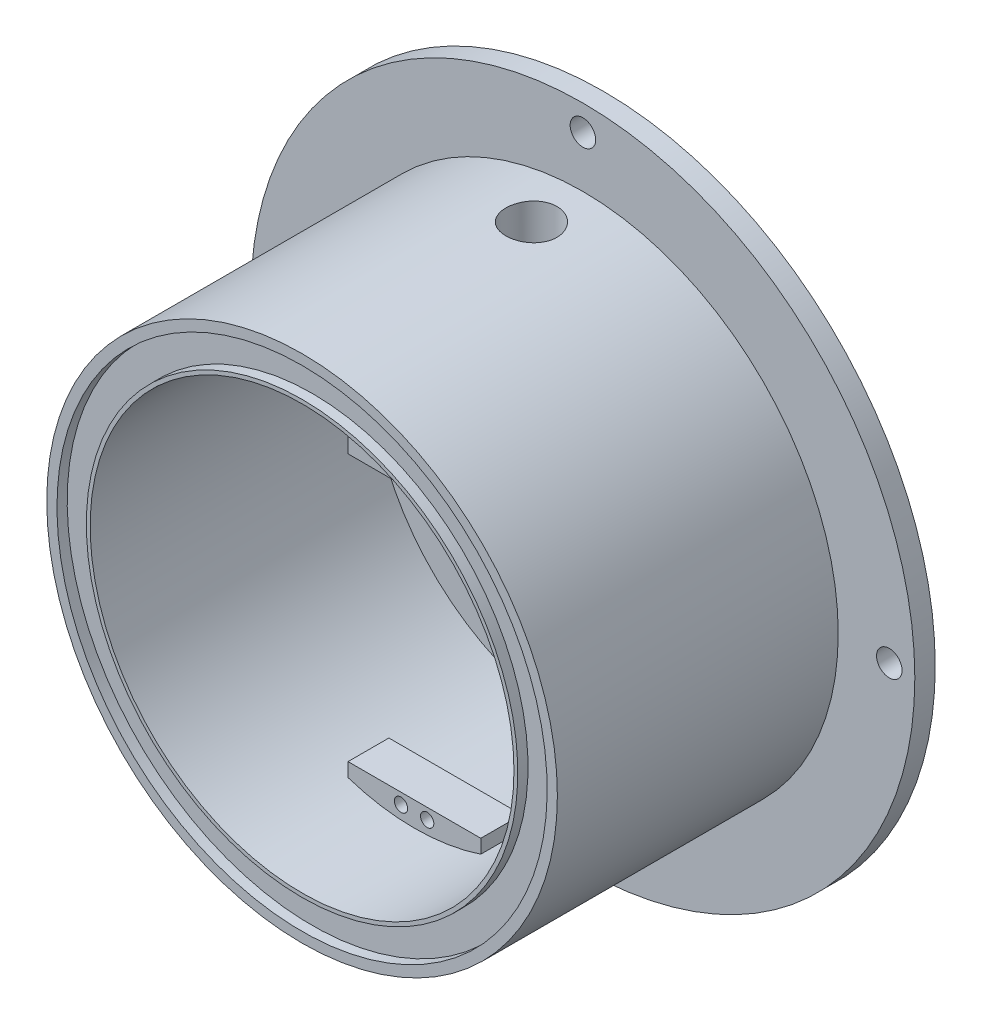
ISO-10303-21;
HEADER;
FILE_DESCRIPTION(('STEP AP214'),'2;1');
FILE_NAME('part.step','',(''),(''),'','','');
FILE_SCHEMA(('AUTOMOTIVE_DESIGN { 1 0 10303 214 1 1 1 1 }'));
ENDSEC;
DATA;
#1=APPLICATION_CONTEXT('core data for automotive mechanical design processes');
#2=APPLICATION_PROTOCOL_DEFINITION('international standard','automotive_design',2000,#1);
#3=PRODUCT_CONTEXT('',#1,'mechanical');
#4=PRODUCT('Part','Part','',(#3));
#5=PRODUCT_RELATED_PRODUCT_CATEGORY('part','',(#4));
#6=PRODUCT_DEFINITION_FORMATION('','',#4);
#7=PRODUCT_DEFINITION_CONTEXT('part definition',#1,'design');
#8=PRODUCT_DEFINITION('design','',#6,#7);
#9=PRODUCT_DEFINITION_SHAPE('','',#8);
#10=(LENGTH_UNIT() NAMED_UNIT(*) SI_UNIT(.MILLI.,.METRE.));
#11=(NAMED_UNIT(*) PLANE_ANGLE_UNIT() SI_UNIT($,.RADIAN.));
#12=(NAMED_UNIT(*) SI_UNIT($,.STERADIAN.) SOLID_ANGLE_UNIT());
#13=UNCERTAINTY_MEASURE_WITH_UNIT(LENGTH_MEASURE(1.E-05),#10,'distance_accuracy_value','');
#14=(GEOMETRIC_REPRESENTATION_CONTEXT(3) GLOBAL_UNCERTAINTY_ASSIGNED_CONTEXT((#13)) GLOBAL_UNIT_ASSIGNED_CONTEXT((#10,
#11,#12)) REPRESENTATION_CONTEXT('',''));
#15=CARTESIAN_POINT('',(0.,0.,0.));
#16=DIRECTION('',(0.,0.,1.));
#17=DIRECTION('',(1.,0.,0.));
#18=AXIS2_PLACEMENT_3D('',#15,#16,#17);
#19=CARTESIAN_POINT('',(0.,0.,57.));
#20=DIRECTION('',(0.,0.,-1.));
#21=DIRECTION('',(0.,-1.,0.));
#22=AXIS2_PLACEMENT_3D('',#19,#20,#21);
#23=PLANE('',#22);
#24=CARTESIAN_POINT('',(0.,0.,57.));
#25=DIRECTION('',(0.,0.,-1.));
#26=DIRECTION('',(0.,1.,0.));
#27=AXIS2_PLACEMENT_3D('',#24,#25,#26);
#28=CIRCLE('',#27,48.);
#29=CARTESIAN_POINT('',(0.,48.,57.));
#30=VERTEX_POINT('',#29);
#31=EDGE_CURVE('E9',#30,#30,#28,.T.);
#32=ORIENTED_EDGE('',*,*,#31,.F.);
#33=EDGE_LOOP('',(#32));
#34=FACE_BOUND('',#33,.T.);
#35=CARTESIAN_POINT('',(0.,0.,57.));
#36=DIRECTION('',(0.,0.,-1.));
#37=DIRECTION('',(0.,1.,0.));
#38=AXIS2_PLACEMENT_3D('',#35,#36,#37);
#39=CIRCLE('',#38,42.25);
#40=CARTESIAN_POINT('',(0.,42.25,57.));
#41=VERTEX_POINT('',#40);
#42=EDGE_CURVE('E28',#41,#41,#39,.T.);
#43=ORIENTED_EDGE('',*,*,#42,.T.);
#44=EDGE_LOOP('',(#43));
#45=FACE_BOUND('',#44,.T.);
#46=ADVANCED_FACE('F15',(#34,#45),#23,.F.);
#47=CARTESIAN_POINT('',(0.,0.,57.));
#48=DIRECTION('',(0.,0.,1.));
#49=DIRECTION('',(1.,0.,0.));
#50=AXIS2_PLACEMENT_3D('',#47,#48,#49);
#51=CYLINDRICAL_SURFACE('',#50,48.);
#52=CARTESIAN_POINT('',(0.,0.,59.));
#53=DIRECTION('',(0.,0.,-1.));
#54=DIRECTION('',(0.,1.,0.));
#55=AXIS2_PLACEMENT_3D('',#52,#53,#54);
#56=CIRCLE('',#55,48.);
#57=CARTESIAN_POINT('',(0.,48.,59.));
#58=VERTEX_POINT('',#57);
#59=EDGE_CURVE('E300',#58,#58,#56,.T.);
#60=ORIENTED_EDGE('',*,*,#59,.F.);
#61=EDGE_LOOP('',(#60));
#62=FACE_BOUND('',#61,.T.);
#63=ORIENTED_EDGE('',*,*,#31,.T.);
#64=EDGE_LOOP('',(#63));
#65=FACE_BOUND('',#64,.T.);
#66=ADVANCED_FACE('F418',(#62,#65),#51,.F.);
#67=CARTESIAN_POINT('',(0.,0.,57.));
#68=DIRECTION('',(0.,0.,1.));
#69=DIRECTION('',(1.,0.,0.));
#70=AXIS2_PLACEMENT_3D('',#67,#68,#69);
#71=CYLINDRICAL_SURFACE('',#70,42.25);
#72=CARTESIAN_POINT('',(0.,0.,59.));
#73=DIRECTION('',(0.,0.,-1.));
#74=DIRECTION('',(0.,1.,0.));
#75=AXIS2_PLACEMENT_3D('',#72,#73,#74);
#76=CIRCLE('',#75,42.25);
#77=CARTESIAN_POINT('',(0.,42.25,59.));
#78=VERTEX_POINT('',#77);
#79=EDGE_CURVE('E580',#78,#78,#76,.T.);
#80=ORIENTED_EDGE('',*,*,#79,.T.);
#81=EDGE_LOOP('',(#80));
#82=FACE_BOUND('',#81,.T.);
#83=ORIENTED_EDGE('',*,*,#42,.F.);
#84=EDGE_LOOP('',(#83));
#85=FACE_BOUND('',#84,.T.);
#86=ADVANCED_FACE('F17',(#82,#85),#71,.T.);
#87=CARTESIAN_POINT('',(-60.,0.,340.090234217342));
#88=DIRECTION('',(0.,0.,-1.));
#89=DIRECTION('',(-1.,0.,0.));
#90=AXIS2_PLACEMENT_3D('',#87,#88,#89);
#91=CYLINDRICAL_SURFACE('',#90,2.5);
#92=CARTESIAN_POINT('',(-60.,0.,4.));
#93=DIRECTION('',(0.,0.,-1.));
#94=DIRECTION('',(-1.,0.,0.));
#95=AXIS2_PLACEMENT_3D('',#92,#93,#94);
#96=CIRCLE('',#95,2.5);
#97=CARTESIAN_POINT('',(-62.5,0.,4.));
#98=VERTEX_POINT('',#97);
#99=EDGE_CURVE('E293',#98,#98,#96,.T.);
#100=ORIENTED_EDGE('',*,*,#99,.F.);
#101=EDGE_LOOP('',(#100));
#102=FACE_BOUND('',#101,.T.);
#103=CARTESIAN_POINT('',(-60.,0.,0.));
#104=DIRECTION('',(0.,0.,-1.));
#105=DIRECTION('',(1.,0.,0.));
#106=AXIS2_PLACEMENT_3D('',#103,#104,#105);
#107=CIRCLE('',#106,2.5);
#108=CARTESIAN_POINT('',(-57.5,0.,0.));
#109=VERTEX_POINT('',#108);
#110=EDGE_CURVE('E625',#109,#109,#107,.T.);
#111=ORIENTED_EDGE('',*,*,#110,.T.);
#112=EDGE_LOOP('',(#111));
#113=FACE_BOUND('',#112,.T.);
#114=ADVANCED_FACE('F1047',(#102,#113),#91,.F.);
#115=CARTESIAN_POINT('',(0.,-60.,340.090234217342));
#116=DIRECTION('',(0.,0.,-1.));
#117=DIRECTION('',(-1.,0.,0.));
#118=AXIS2_PLACEMENT_3D('',#115,#116,#117);
#119=CYLINDRICAL_SURFACE('',#118,2.5);
#120=CARTESIAN_POINT('',(0.,-60.,4.));
#121=DIRECTION('',(0.,0.,-1.));
#122=DIRECTION('',(-1.,0.,0.));
#123=AXIS2_PLACEMENT_3D('',#120,#121,#122);
#124=CIRCLE('',#123,2.5);
#125=CARTESIAN_POINT('',(-2.5,-60.,4.));
#126=VERTEX_POINT('',#125);
#127=EDGE_CURVE('E296',#126,#126,#124,.T.);
#128=ORIENTED_EDGE('',*,*,#127,.F.);
#129=EDGE_LOOP('',(#128));
#130=FACE_BOUND('',#129,.T.);
#131=CARTESIAN_POINT('',(0.,-60.,0.));
#132=DIRECTION('',(0.,0.,-1.));
#133=DIRECTION('',(1.,0.,0.));
#134=AXIS2_PLACEMENT_3D('',#131,#132,#133);
#135=CIRCLE('',#134,2.5);
#136=CARTESIAN_POINT('',(2.5,-60.,0.));
#137=VERTEX_POINT('',#136);
#138=EDGE_CURVE('E616',#137,#137,#135,.T.);
#139=ORIENTED_EDGE('',*,*,#138,.T.);
#140=EDGE_LOOP('',(#139));
#141=FACE_BOUND('',#140,.T.);
#142=ADVANCED_FACE('F517',(#130,#141),#119,.F.);
#143=CARTESIAN_POINT('',(60.,0.,340.090234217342));
#144=DIRECTION('',(0.,0.,-1.));
#145=DIRECTION('',(-1.,0.,0.));
#146=AXIS2_PLACEMENT_3D('',#143,#144,#145);
#147=CYLINDRICAL_SURFACE('',#146,2.5);
#148=CARTESIAN_POINT('',(60.,0.,4.));
#149=DIRECTION('',(0.,0.,-1.));
#150=DIRECTION('',(-1.,0.,0.));
#151=AXIS2_PLACEMENT_3D('',#148,#149,#150);
#152=CIRCLE('',#151,2.5);
#153=CARTESIAN_POINT('',(57.5,0.,4.));
#154=VERTEX_POINT('',#153);
#155=EDGE_CURVE('E364',#154,#154,#152,.T.);
#156=ORIENTED_EDGE('',*,*,#155,.F.);
#157=EDGE_LOOP('',(#156));
#158=FACE_BOUND('',#157,.T.);
#159=CARTESIAN_POINT('',(60.,0.,0.));
#160=DIRECTION('',(0.,0.,-1.));
#161=DIRECTION('',(1.,0.,0.));
#162=AXIS2_PLACEMENT_3D('',#159,#160,#161);
#163=CIRCLE('',#162,2.5);
#164=CARTESIAN_POINT('',(62.5,0.,0.));
#165=VERTEX_POINT('',#164);
#166=EDGE_CURVE('E222',#165,#165,#163,.T.);
#167=ORIENTED_EDGE('',*,*,#166,.T.);
#168=EDGE_LOOP('',(#167));
#169=FACE_BOUND('',#168,.T.);
#170=ADVANCED_FACE('F503',(#158,#169),#147,.F.);
#171=CARTESIAN_POINT('',(0.,60.,340.090234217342));
#172=DIRECTION('',(0.,0.,-1.));
#173=DIRECTION('',(-1.,0.,0.));
#174=AXIS2_PLACEMENT_3D('',#171,#172,#173);
#175=CYLINDRICAL_SURFACE('',#174,2.5);
#176=CARTESIAN_POINT('',(0.,60.,4.));
#177=DIRECTION('',(0.,0.,-1.));
#178=DIRECTION('',(-1.,0.,0.));
#179=AXIS2_PLACEMENT_3D('',#176,#177,#178);
#180=CIRCLE('',#179,2.5);
#181=CARTESIAN_POINT('',(-2.5,60.,4.));
#182=VERTEX_POINT('',#181);
#183=EDGE_CURVE('E368',#182,#182,#180,.T.);
#184=ORIENTED_EDGE('',*,*,#183,.F.);
#185=EDGE_LOOP('',(#184));
#186=FACE_BOUND('',#185,.T.);
#187=CARTESIAN_POINT('',(0.,60.,0.));
#188=DIRECTION('',(0.,0.,-1.));
#189=DIRECTION('',(1.,0.,0.));
#190=AXIS2_PLACEMENT_3D('',#187,#188,#189);
#191=CIRCLE('',#190,2.5);
#192=CARTESIAN_POINT('',(2.5,60.,0.));
#193=VERTEX_POINT('',#192);
#194=EDGE_CURVE('E213',#193,#193,#191,.T.);
#195=ORIENTED_EDGE('',*,*,#194,.T.);
#196=EDGE_LOOP('',(#195));
#197=FACE_BOUND('',#196,.T.);
#198=ADVANCED_FACE('F499',(#186,#197),#175,.F.);
#199=CARTESIAN_POINT('',(0.,0.,37.));
#200=DIRECTION('',(0.,0.,1.));
#201=DIRECTION('',(1.,0.,0.));
#202=AXIS2_PLACEMENT_3D('',#199,#200,#201);
#203=PLANE('',#202);
#204=DIRECTION('',(0.,1.,0.));
#205=VECTOR('',#204,1.);
#206=CARTESIAN_POINT('',(13.,-36.697694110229,37.));
#207=LINE('',#206,#205);
#208=CARTESIAN_POINT('',(13.,-39.4112927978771,37.));
#209=VERTEX_POINT('',#208);
#210=CARTESIAN_POINT('',(13.,-36.697694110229,37.));
#211=VERTEX_POINT('',#210);
#212=EDGE_CURVE('E337',#209,#211,#207,.T.);
#213=ORIENTED_EDGE('',*,*,#212,.T.);
#214=DIRECTION('',(-1.,0.,0.));
#215=VECTOR('',#214,1.);
#216=CARTESIAN_POINT('',(13.,-36.697694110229,37.));
#217=LINE('',#216,#215);
#218=CARTESIAN_POINT('',(-13.,-36.697694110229,37.));
#219=VERTEX_POINT('',#218);
#220=EDGE_CURVE('E103',#211,#219,#217,.T.);
#221=ORIENTED_EDGE('',*,*,#220,.T.);
#222=DIRECTION('',(0.,-1.,0.));
#223=VECTOR('',#222,1.);
#224=CARTESIAN_POINT('',(-13.,-36.697694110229,37.));
#225=LINE('',#224,#223);
#226=CARTESIAN_POINT('',(-13.,-39.4112927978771,37.));
#227=VERTEX_POINT('',#226);
#228=EDGE_CURVE('E354',#219,#227,#225,.T.);
#229=ORIENTED_EDGE('',*,*,#228,.T.);
#230=CARTESIAN_POINT('',(0.,0.,37.));
#231=DIRECTION('',(0.,0.,1.));
#232=DIRECTION('',(-1.,0.,0.));
#233=AXIS2_PLACEMENT_3D('',#230,#231,#232);
#234=CIRCLE('',#233,41.5);
#235=EDGE_CURVE('E359',#227,#209,#234,.T.);
#236=ORIENTED_EDGE('',*,*,#235,.T.);
#237=EDGE_LOOP('',(#213,#221,#229,#236));
#238=FACE_BOUND('',#237,.T.);
#239=CARTESIAN_POINT('',(-2.62881463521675,-38.824630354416,37.));
#240=DIRECTION('',(0.,0.,-1.));
#241=DIRECTION('',(-1.,0.,0.));
#242=AXIS2_PLACEMENT_3D('',#239,#240,#241);
#243=CIRCLE('',#242,1.3);
#244=CARTESIAN_POINT('',(-3.92881463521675,-38.824630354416,37.));
#245=VERTEX_POINT('',#244);
#246=EDGE_CURVE('E355',#245,#245,#243,.T.);
#247=ORIENTED_EDGE('',*,*,#246,.T.);
#248=EDGE_LOOP('',(#247));
#249=FACE_BOUND('',#248,.T.);
#250=CARTESIAN_POINT('',(2.5,-38.824630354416,37.));
#251=DIRECTION('',(0.,0.,-1.));
#252=DIRECTION('',(-1.,0.,0.));
#253=AXIS2_PLACEMENT_3D('',#250,#251,#252);
#254=CIRCLE('',#253,1.3);
#255=CARTESIAN_POINT('',(1.2,-38.824630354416,37.));
#256=VERTEX_POINT('',#255);
#257=EDGE_CURVE('E322',#256,#256,#254,.T.);
#258=ORIENTED_EDGE('',*,*,#257,.T.);
#259=EDGE_LOOP('',(#258));
#260=FACE_BOUND('',#259,.T.);
#261=ADVANCED_FACE('F502',(#238,#249,#260),#203,.T.);
#262=CARTESIAN_POINT('',(0.,0.,29.));
#263=DIRECTION('',(0.,0.,1.));
#264=DIRECTION('',(1.,0.,0.));
#265=AXIS2_PLACEMENT_3D('',#262,#263,#264);
#266=PLANE('',#265);
#267=DIRECTION('',(0.,1.,0.));
#268=VECTOR('',#267,1.);
#269=CARTESIAN_POINT('',(13.,-36.697694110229,29.));
#270=LINE('',#269,#268);
#271=CARTESIAN_POINT('',(13.,-39.4112927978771,29.));
#272=VERTEX_POINT('',#271);
#273=CARTESIAN_POINT('',(13.,-36.697694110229,29.));
#274=VERTEX_POINT('',#273);
#275=EDGE_CURVE('E384',#272,#274,#270,.T.);
#276=ORIENTED_EDGE('',*,*,#275,.F.);
#277=CARTESIAN_POINT('',(0.,0.,29.));
#278=DIRECTION('',(0.,0.,1.));
#279=DIRECTION('',(-1.,0.,0.));
#280=AXIS2_PLACEMENT_3D('',#277,#278,#279);
#281=CIRCLE('',#280,41.5);
#282=CARTESIAN_POINT('',(-13.,-39.4112927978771,29.));
#283=VERTEX_POINT('',#282);
#284=EDGE_CURVE('E393',#283,#272,#281,.T.);
#285=ORIENTED_EDGE('',*,*,#284,.F.);
#286=DIRECTION('',(0.,-1.,0.));
#287=VECTOR('',#286,1.);
#288=CARTESIAN_POINT('',(-13.,-36.697694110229,29.));
#289=LINE('',#288,#287);
#290=CARTESIAN_POINT('',(-13.,-36.697694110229,29.));
#291=VERTEX_POINT('',#290);
#292=EDGE_CURVE('E350',#291,#283,#289,.T.);
#293=ORIENTED_EDGE('',*,*,#292,.F.);
#294=DIRECTION('',(-1.,0.,0.));
#295=VECTOR('',#294,1.);
#296=CARTESIAN_POINT('',(13.,-36.697694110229,29.));
#297=LINE('',#296,#295);
#298=EDGE_CURVE('E115',#274,#291,#297,.T.);
#299=ORIENTED_EDGE('',*,*,#298,.F.);
#300=EDGE_LOOP('',(#276,#285,#293,#299));
#301=FACE_BOUND('',#300,.T.);
#302=CARTESIAN_POINT('',(-2.62881463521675,-38.824630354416,29.));
#303=DIRECTION('',(0.,0.,-1.));
#304=DIRECTION('',(-1.,0.,0.));
#305=AXIS2_PLACEMENT_3D('',#302,#303,#304);
#306=CIRCLE('',#305,1.3);
#307=CARTESIAN_POINT('',(-3.92881463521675,-38.824630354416,29.));
#308=VERTEX_POINT('',#307);
#309=EDGE_CURVE('E353',#308,#308,#306,.T.);
#310=ORIENTED_EDGE('',*,*,#309,.F.);
#311=EDGE_LOOP('',(#310));
#312=FACE_BOUND('',#311,.T.);
#313=CARTESIAN_POINT('',(2.5,-38.824630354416,29.));
#314=DIRECTION('',(0.,0.,-1.));
#315=DIRECTION('',(-1.,0.,0.));
#316=AXIS2_PLACEMENT_3D('',#313,#314,#315);
#317=CIRCLE('',#316,1.3);
#318=CARTESIAN_POINT('',(1.2,-38.824630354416,29.));
#319=VERTEX_POINT('',#318);
#320=EDGE_CURVE('E358',#319,#319,#317,.T.);
#321=ORIENTED_EDGE('',*,*,#320,.F.);
#322=EDGE_LOOP('',(#321));
#323=FACE_BOUND('',#322,.T.);
#324=ADVANCED_FACE('F434',(#301,#312,#323),#266,.F.);
#325=CARTESIAN_POINT('',(2.5,-38.824630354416,29.));
#326=DIRECTION('',(0.,0.,1.));
#327=DIRECTION('',(1.,0.,0.));
#328=AXIS2_PLACEMENT_3D('',#325,#326,#327);
#329=CYLINDRICAL_SURFACE('',#328,1.3);
#330=ORIENTED_EDGE('',*,*,#257,.F.);
#331=EDGE_LOOP('',(#330));
#332=FACE_BOUND('',#331,.T.);
#333=ORIENTED_EDGE('',*,*,#320,.T.);
#334=EDGE_LOOP('',(#333));
#335=FACE_BOUND('',#334,.T.);
#336=ADVANCED_FACE('F432',(#332,#335),#329,.F.);
#337=CARTESIAN_POINT('',(-2.62881463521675,-38.824630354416,29.));
#338=DIRECTION('',(0.,0.,1.));
#339=DIRECTION('',(1.,0.,0.));
#340=AXIS2_PLACEMENT_3D('',#337,#338,#339);
#341=CYLINDRICAL_SURFACE('',#340,1.3);
#342=ORIENTED_EDGE('',*,*,#246,.F.);
#343=EDGE_LOOP('',(#342));
#344=FACE_BOUND('',#343,.T.);
#345=ORIENTED_EDGE('',*,*,#309,.T.);
#346=EDGE_LOOP('',(#345));
#347=FACE_BOUND('',#346,.T.);
#348=ADVANCED_FACE('F414',(#344,#347),#341,.F.);
#349=CARTESIAN_POINT('',(-13.,-36.697694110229,29.));
#350=DIRECTION('',(-1.,0.,0.));
#351=DIRECTION('',(0.,0.,1.));
#352=AXIS2_PLACEMENT_3D('',#349,#350,#351);
#353=PLANE('',#352);
#354=ORIENTED_EDGE('',*,*,#228,.F.);
#355=DIRECTION('',(0.,0.,1.));
#356=VECTOR('',#355,1.);
#357=CARTESIAN_POINT('',(-13.,-36.697694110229,29.));
#358=LINE('',#357,#356);
#359=EDGE_CURVE('E744',#291,#219,#358,.T.);
#360=ORIENTED_EDGE('',*,*,#359,.F.);
#361=ORIENTED_EDGE('',*,*,#292,.T.);
#362=DIRECTION('',(0.,0.,1.));
#363=VECTOR('',#362,1.);
#364=CARTESIAN_POINT('',(-13.,-39.4112927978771,29.));
#365=LINE('',#364,#363);
#366=EDGE_CURVE('E576',#283,#227,#365,.T.);
#367=ORIENTED_EDGE('',*,*,#366,.T.);
#368=EDGE_LOOP('',(#354,#360,#361,#367));
#369=FACE_BOUND('',#368,.T.);
#370=ADVANCED_FACE('F495',(#369),#353,.T.);
#371=CARTESIAN_POINT('',(13.,-36.697694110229,29.));
#372=DIRECTION('',(0.,1.,0.));
#373=DIRECTION('',(1.,0.,0.));
#374=AXIS2_PLACEMENT_3D('',#371,#372,#373);
#375=PLANE('',#374);
#376=ORIENTED_EDGE('',*,*,#220,.F.);
#377=DIRECTION('',(0.,0.,1.));
#378=VECTOR('',#377,1.);
#379=CARTESIAN_POINT('',(13.,-36.697694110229,29.));
#380=LINE('',#379,#378);
#381=EDGE_CURVE('E381',#274,#211,#380,.T.);
#382=ORIENTED_EDGE('',*,*,#381,.F.);
#383=ORIENTED_EDGE('',*,*,#298,.T.);
#384=ORIENTED_EDGE('',*,*,#359,.T.);
#385=EDGE_LOOP('',(#376,#382,#383,#384));
#386=FACE_BOUND('',#385,.T.);
#387=ADVANCED_FACE('F460',(#386),#375,.T.);
#388=CARTESIAN_POINT('',(13.,-36.697694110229,29.));
#389=DIRECTION('',(1.,0.,0.));
#390=DIRECTION('',(0.,1.,0.));
#391=AXIS2_PLACEMENT_3D('',#388,#389,#390);
#392=PLANE('',#391);
#393=ORIENTED_EDGE('',*,*,#212,.F.);
#394=DIRECTION('',(0.,0.,1.));
#395=VECTOR('',#394,1.);
#396=CARTESIAN_POINT('',(13.,-39.4112927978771,29.));
#397=LINE('',#396,#395);
#398=EDGE_CURVE('E363',#272,#209,#397,.T.);
#399=ORIENTED_EDGE('',*,*,#398,.F.);
#400=ORIENTED_EDGE('',*,*,#275,.T.);
#401=ORIENTED_EDGE('',*,*,#381,.T.);
#402=EDGE_LOOP('',(#393,#399,#400,#401));
#403=FACE_BOUND('',#402,.T.);
#404=ADVANCED_FACE('F457',(#403),#392,.T.);
#405=CARTESIAN_POINT('',(0.,59.0863731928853,14.0863044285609));
#406=DIRECTION('',(0.,-1.,0.));
#407=DIRECTION('',(0.,0.,-1.));
#408=AXIS2_PLACEMENT_3D('',#405,#406,#407);
#409=CYLINDRICAL_SURFACE('',#408,5.);
#410=CARTESIAN_POINT('',(0.,41.5,9.0863044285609));
#411=CARTESIAN_POINT('',(0.0566877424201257,41.4999989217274,9.08630396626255));
#412=CARTESIAN_POINT('',(0.113375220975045,41.4997952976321,9.08726844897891));
#413=CARTESIAN_POINT('',(0.230034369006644,41.4990145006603,9.0912380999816));
#414=CARTESIAN_POINT('',(0.290001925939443,41.4984159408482,9.09436062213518));
#415=CARTESIAN_POINT('',(0.413129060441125,41.4968463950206,9.10299795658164));
#416=CARTESIAN_POINT('',(0.476279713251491,41.4958564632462,9.10863672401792));
#417=CARTESIAN_POINT('',(0.605653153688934,41.4935010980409,9.12267279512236));
#418=CARTESIAN_POINT('',(0.671861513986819,41.492118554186,9.13120037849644));
#419=CARTESIAN_POINT('',(0.807198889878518,41.4889765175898,9.15139373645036));
#420=CARTESIAN_POINT('',(0.876307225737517,41.4872015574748,9.16319583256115));
#421=CARTESIAN_POINT('',(1.01725805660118,41.4832730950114,9.19032845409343));
#422=CARTESIAN_POINT('',(1.08907284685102,41.4811055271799,9.20580097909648));
#423=CARTESIAN_POINT('',(1.23521151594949,41.4763905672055,9.24067228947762));
#424=CARTESIAN_POINT('',(1.30949986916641,41.4738303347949,9.26021831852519));
#425=CARTESIAN_POINT('',(1.46031855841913,41.468328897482,9.30363842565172));
#426=CARTESIAN_POINT('',(1.5368047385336,41.4653759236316,9.3276644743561));
#427=CARTESIAN_POINT('',(1.69170665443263,41.4590880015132,9.38044621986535));
#428=CARTESIAN_POINT('',(1.77006879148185,41.4557422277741,9.40935800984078));
#429=CARTESIAN_POINT('',(1.92836160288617,41.4486678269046,9.47230773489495));
#430=CARTESIAN_POINT('',(2.00822842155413,41.444929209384,9.50650518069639));
#431=CARTESIAN_POINT('',(2.16911881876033,41.4370683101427,9.58041265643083));
#432=CARTESIAN_POINT('',(2.25006751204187,41.4329367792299,9.62028482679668));
#433=CARTESIAN_POINT('',(2.41265418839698,41.4242894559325,9.70591019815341));
#434=CARTESIAN_POINT('',(2.49420541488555,41.4197650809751,9.75182720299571));
#435=CARTESIAN_POINT('',(2.65748207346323,41.4103310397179,9.84989329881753));
#436=CARTESIAN_POINT('',(2.73910844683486,41.4054133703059,9.90220705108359));
#437=CARTESIAN_POINT('',(2.8601896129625,41.3978137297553,9.98486712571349));
#438=CARTESIAN_POINT('',(2.9008252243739,41.3952091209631,10.0135063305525));
#439=CARTESIAN_POINT('',(2.98190341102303,41.3899023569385,10.0724774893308));
#440=CARTESIAN_POINT('',(3.0223310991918,41.3871992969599,10.102829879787));
#441=CARTESIAN_POINT('',(3.10290953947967,41.381696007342,10.1652595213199));
#442=CARTESIAN_POINT('',(3.14304450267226,41.3788949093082,10.1973570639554));
#443=CARTESIAN_POINT('',(3.22295227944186,41.373194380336,10.2633074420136));
#444=CARTESIAN_POINT('',(3.26270842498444,41.3702940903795,10.2971804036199));
#445=CARTESIAN_POINT('',(3.34176938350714,41.3643993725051,10.366708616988));
#446=CARTESIAN_POINT('',(3.38105662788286,41.3614041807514,10.4023837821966));
#447=CARTESIAN_POINT('',(3.45908646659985,41.3553035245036,10.4755391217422));
#448=CARTESIAN_POINT('',(3.49781056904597,41.3521970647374,10.5130389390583));
#449=CARTESIAN_POINT('',(3.57412586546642,41.34597571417,10.5893708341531));
#450=CARTESIAN_POINT('',(3.61171382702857,41.3428608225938,10.628206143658));
#451=CARTESIAN_POINT('',(3.68503060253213,41.3367435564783,10.7064555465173));
#452=CARTESIAN_POINT('',(3.72077938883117,41.3337401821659,10.7458508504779));
#453=CARTESIAN_POINT('',(3.79044074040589,41.3278293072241,10.825123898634));
#454=CARTESIAN_POINT('',(3.82437355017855,41.3249210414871,10.8649837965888));
#455=CARTESIAN_POINT('',(3.89043030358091,41.3192047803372,10.9450939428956));
#456=CARTESIAN_POINT('',(3.92257470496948,41.3163959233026,10.9853272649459));
#457=CARTESIAN_POINT('',(3.98508557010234,41.310877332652,11.0660962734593));
#458=CARTESIAN_POINT('',(4.01547265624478,41.3081667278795,11.1066159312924));
#459=CARTESIAN_POINT('',(4.07450156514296,41.3028450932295,11.1878709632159));
#460=CARTESIAN_POINT('',(4.10316415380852,41.3002331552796,11.2285912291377));
#461=CARTESIAN_POINT('',(4.18586902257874,41.2926128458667,11.3498995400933));
#462=CARTESIAN_POINT('',(4.23819923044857,41.2876811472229,11.4316702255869));
#463=CARTESIAN_POINT('',(4.3362611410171,41.2782199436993,11.5951985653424));
#464=CARTESIAN_POINT('',(4.38216005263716,41.2736823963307,11.6768557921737));
#465=CARTESIAN_POINT('',(4.46771956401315,41.2650096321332,11.8396127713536));
#466=CARTESIAN_POINT('',(4.50754642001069,41.260865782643,11.9206246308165));
#467=CARTESIAN_POINT('',(4.58134094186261,41.252981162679,12.0815959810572));
#468=CARTESIAN_POINT('',(4.6154730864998,41.2492310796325,12.1614796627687));
#469=CARTESIAN_POINT('',(4.6782770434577,41.2421346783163,12.3197581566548));
#470=CARTESIAN_POINT('',(4.70711057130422,41.2387782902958,12.3980883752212));
#471=CARTESIAN_POINT('',(4.75972747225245,41.2324700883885,12.5528766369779));
#472=CARTESIAN_POINT('',(4.78366899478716,41.2295073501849,12.6292805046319));
#473=CARTESIAN_POINT('',(4.82691816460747,41.2239873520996,12.7798837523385));
#474=CARTESIAN_POINT('',(4.84637967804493,41.2214182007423,12.8540385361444));
#475=CARTESIAN_POINT('',(4.88108602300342,41.2166864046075,12.9998589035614));
#476=CARTESIAN_POINT('',(4.89647982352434,41.2145107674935,13.0714886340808));
#477=CARTESIAN_POINT('',(4.92346446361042,41.2105671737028,13.2120183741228));
#478=CARTESIAN_POINT('',(4.93519885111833,41.2087849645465,13.2808904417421));
#479=CARTESIAN_POINT('',(4.9552710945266,41.2056295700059,13.4157049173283));
#480=CARTESIAN_POINT('',(4.96374663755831,41.2042406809,13.481626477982));
#481=CARTESIAN_POINT('',(4.97769708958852,41.2018734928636,13.6103768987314));
#482=CARTESIAN_POINT('',(4.98330346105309,41.2008778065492,13.6731912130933));
#483=CARTESIAN_POINT('',(4.99189821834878,41.1992987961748,13.7955973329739));
#484=CARTESIAN_POINT('',(4.99501154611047,41.1986961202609,13.8551801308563));
#485=CARTESIAN_POINT('',(4.99898738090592,41.1979053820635,13.9710228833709));
#486=CARTESIAN_POINT('',(4.9999680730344,41.1976956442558,14.0272786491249));
#487=CARTESIAN_POINT('',(5.0000304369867,41.1976927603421,14.1398707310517));
#488=CARTESIAN_POINT('',(4.99910942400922,41.1979002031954,14.1962070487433));
#489=CARTESIAN_POINT('',(4.99525108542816,41.1986862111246,14.3122136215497));
#490=CARTESIAN_POINT('',(4.99219538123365,41.1992864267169,14.3718798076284));
#491=CARTESIAN_POINT('',(4.98371336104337,41.2008606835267,14.4944554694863));
#492=CARTESIAN_POINT('',(4.97816190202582,41.2018540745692,14.5573560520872));
#493=CARTESIAN_POINT('',(4.96431809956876,41.2042167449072,14.6862817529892));
#494=CARTESIAN_POINT('',(4.95589408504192,41.2056034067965,14.7522924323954));
#495=CARTESIAN_POINT('',(4.93592104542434,41.2087544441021,14.8872878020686));
#496=CARTESIAN_POINT('',(4.92423411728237,41.2105345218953,14.9562517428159));
#497=CARTESIAN_POINT('',(4.89733985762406,41.2144739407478,15.0969677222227));
#498=CARTESIAN_POINT('',(4.88198875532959,41.2166475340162,15.1686919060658));
#499=CARTESIAN_POINT('',(4.84736258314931,41.2213753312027,15.314703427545));
#500=CARTESIAN_POINT('',(4.8279383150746,41.2239425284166,15.3889549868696));
#501=CARTESIAN_POINT('',(4.78475773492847,41.2294587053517,15.5397536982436));
#502=CARTESIAN_POINT('',(4.76084732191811,41.2324195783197,15.6162563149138));
#503=CARTESIAN_POINT('',(4.70828607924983,41.238724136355,15.77124355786));
#504=CARTESIAN_POINT('',(4.67947686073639,41.2420787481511,15.8496740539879));
#505=CARTESIAN_POINT('',(4.61671433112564,41.2491716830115,16.0081540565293));
#506=CARTESIAN_POINT('',(4.58259906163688,41.2529200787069,16.0881389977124));
#507=CARTESIAN_POINT('',(4.50883050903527,41.2608014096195,16.2493131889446));
#508=CARTESIAN_POINT('',(4.46901250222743,41.2649436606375,16.3304266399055));
#509=CARTESIAN_POINT('',(4.38346237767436,41.2736133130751,16.4933863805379));
#510=CARTESIAN_POINT('',(4.33756375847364,41.27814935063,16.5751447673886));
#511=CARTESIAN_POINT('',(4.23949364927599,41.2876076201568,16.7388741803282));
#512=CARTESIAN_POINT('',(4.18715470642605,41.2925378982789,16.8207447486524));
#513=CARTESIAN_POINT('',(4.10442957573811,41.3001562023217,16.9422006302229));
#514=CARTESIAN_POINT('',(4.07575914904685,41.3027674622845,16.9829699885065));
#515=CARTESIAN_POINT('',(4.01671221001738,41.3080877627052,17.0643225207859));
#516=CARTESIAN_POINT('',(3.98631490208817,41.3107977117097,17.1048905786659));
#517=CARTESIAN_POINT('',(3.92378121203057,41.3163150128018,17.185755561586));
#518=CARTESIAN_POINT('',(3.89162417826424,41.3191232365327,17.2260364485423));
#519=CARTESIAN_POINT('',(3.82553975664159,41.3248382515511,17.3062407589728));
#520=CARTESIAN_POINT('',(3.79159188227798,41.3277459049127,17.3461472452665));
#521=CARTESIAN_POINT('',(3.72189798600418,41.3336555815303,17.4255123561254));
#522=CARTESIAN_POINT('',(3.68613169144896,41.33665837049,17.4649531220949));
#523=CARTESIAN_POINT('',(3.61277747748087,41.3427744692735,17.543292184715));
#524=CARTESIAN_POINT('',(3.57516955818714,41.3458887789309,17.5821716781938));
#525=CARTESIAN_POINT('',(3.49882702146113,41.3521078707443,17.6585750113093));
#526=CARTESIAN_POINT('',(3.46009613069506,41.355212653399,17.6961025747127));
#527=CARTESIAN_POINT('',(3.3820524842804,41.3613101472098,17.7693111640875));
#528=CARTESIAN_POINT('',(3.34275827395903,41.3643038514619,17.8050118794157));
#529=CARTESIAN_POINT('',(3.26368335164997,41.3701957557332,17.8745890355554));
#530=CARTESIAN_POINT('',(3.22392025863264,41.37309471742,17.9084854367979));
#531=CARTESIAN_POINT('',(3.14399874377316,41.3787927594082,17.974480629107));
#532=CARTESIAN_POINT('',(3.10385703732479,41.3815926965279,18.0065995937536));
#533=CARTESIAN_POINT('',(3.02326544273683,41.3870938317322,18.0690701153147));
#534=CARTESIAN_POINT('',(2.98283138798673,41.3897958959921,18.0994420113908));
#535=CARTESIAN_POINT('',(2.90174096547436,41.3951008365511,18.1584503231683));
#536=CARTESIAN_POINT('',(2.8610995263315,41.3977046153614,18.1871072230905));
#537=CARTESIAN_POINT('',(2.74000395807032,41.4053019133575,18.2698159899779));
#538=CARTESIAN_POINT('',(2.65836809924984,41.4102184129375,18.3221601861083));
#539=CARTESIAN_POINT('',(2.49507599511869,41.4196507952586,18.4202809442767));
#540=CARTESIAN_POINT('',(2.41351907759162,41.4241746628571,18.4662225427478));
#541=CARTESIAN_POINT('',(2.25092544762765,41.4328216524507,18.5518918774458));
#542=CARTESIAN_POINT('',(2.16997572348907,41.4369533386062,18.5917837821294));
#543=CARTESIAN_POINT('',(2.00908843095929,41.444815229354,18.6657265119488));
#544=CARTESIAN_POINT('',(1.92922594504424,41.448554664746,18.6999398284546));
#545=CARTESIAN_POINT('',(1.77094754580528,41.4556313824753,18.7629180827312));
#546=CARTESIAN_POINT('',(1.69259565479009,41.4589786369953,18.7918428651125));
#547=CARTESIAN_POINT('',(1.53772041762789,41.4652702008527,18.8446483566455));
#548=CARTESIAN_POINT('',(1.46125080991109,41.4682253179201,18.8686854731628));
#549=CARTESIAN_POINT('',(1.31047176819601,41.4737317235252,18.9121264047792));
#550=CARTESIAN_POINT('',(1.23620660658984,41.4762947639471,18.9316824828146));
#551=CARTESIAN_POINT('',(1.090121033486,41.4810160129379,18.9665734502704));
#552=CARTESIAN_POINT('',(1.01833624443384,41.4831870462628,18.9820558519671));
#553=CARTESIAN_POINT('',(0.877452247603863,41.4871231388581,19.0092085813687));
#554=CARTESIAN_POINT('',(0.808380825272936,41.4889022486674,19.0210211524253));
#555=CARTESIAN_POINT('',(0.673124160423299,41.4920531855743,19.0412365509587));
#556=CARTESIAN_POINT('',(0.606959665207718,41.4934404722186,19.0497759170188));
#557=CARTESIAN_POINT('',(0.477680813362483,41.4958062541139,19.063837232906));
#558=CARTESIAN_POINT('',(0.414580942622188,41.4968018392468,19.0694896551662));
#559=CARTESIAN_POINT('',(0.291562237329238,41.4983824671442,19.0781567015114));
#560=CARTESIAN_POINT('',(0.231652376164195,41.4989864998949,19.0812954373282));
#561=CARTESIAN_POINT('',(0.115115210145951,41.4997819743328,19.0852997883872));
#562=CARTESIAN_POINT('',(0.0584920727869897,41.4999946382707,19.0862829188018));
#563=CARTESIAN_POINT('',(-0.0548224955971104,41.500005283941,19.0863252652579));
#564=CARTESIAN_POINT('',(-0.111513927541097,41.4998027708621,19.0853821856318));
#565=CARTESIAN_POINT('',(-0.228171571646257,41.4990273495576,19.0814562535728));
#566=CARTESIAN_POINT('',(-0.288133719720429,41.4984332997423,19.0783563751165));
#567=CARTESIAN_POINT('',(-0.411241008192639,41.4968723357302,19.0697668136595));
#568=CARTESIAN_POINT('',(-0.474377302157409,41.4958864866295,19.0641535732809));
#569=CARTESIAN_POINT('',(-0.603713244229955,41.4935399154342,19.0501720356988));
#570=CARTESIAN_POINT('',(-0.669898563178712,41.4921621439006,19.0416738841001));
#571=CARTESIAN_POINT('',(-0.805181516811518,41.4890299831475,19.0215441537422));
#572=CARTESIAN_POINT('',(-0.874258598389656,41.487260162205,19.0097767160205));
#573=CARTESIAN_POINT('',(-1.01513914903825,41.4833424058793,18.9827194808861));
#574=CARTESIAN_POINT('',(-1.08691507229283,41.4811804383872,18.967288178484));
#575=CARTESIAN_POINT('',(-1.23296897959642,41.4764770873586,18.9325067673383));
#576=CARTESIAN_POINT('',(-1.30721163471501,41.4739228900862,18.913009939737));
#577=CARTESIAN_POINT('',(-1.45793283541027,41.4684339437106,18.8696971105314));
#578=CARTESIAN_POINT('',(-1.53436746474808,41.4654874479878,18.8457296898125));
#579=CARTESIAN_POINT('',(-1.68916133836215,41.4592129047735,18.7930755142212));
#580=CARTESIAN_POINT('',(-1.76746727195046,41.455874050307,18.7642332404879));
#581=CARTESIAN_POINT('',(-1.92564412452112,41.4488139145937,18.7014342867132));
#582=CARTESIAN_POINT('',(-2.00545152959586,41.445082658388,18.6673186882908));
#583=CARTESIAN_POINT('',(-2.1662211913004,41.4372369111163,18.593588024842));
#584=CARTESIAN_POINT('',(-2.24710896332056,41.4331131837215,18.553811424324));
#585=CARTESIAN_POINT('',(-2.40957381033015,41.4244818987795,18.4683915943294));
#586=CARTESIAN_POINT('',(-2.49106459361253,41.4199657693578,18.4225851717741));
#587=CARTESIAN_POINT('',(-2.65422256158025,41.4105486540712,18.3247558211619));
#588=CARTESIAN_POINT('',(-2.73579121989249,41.4056396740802,18.2725688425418));
#589=CARTESIAN_POINT('',(-2.85679189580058,41.398053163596,18.1901083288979));
#590=CARTESIAN_POINT('',(-2.89740053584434,41.3954530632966,18.161538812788));
#591=CARTESIAN_POINT('',(-2.97842636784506,41.3901554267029,18.1027113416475));
#592=CARTESIAN_POINT('',(-3.01882875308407,41.3874569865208,18.072433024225));
#593=CARTESIAN_POINT('',(-3.09935854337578,41.3819630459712,18.0101559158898));
#594=CARTESIAN_POINT('',(-3.13947024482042,41.3791666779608,17.9781369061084));
#595=CARTESIAN_POINT('',(-3.21933383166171,41.3734757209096,17.9123480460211));
#596=CARTESIAN_POINT('',(-3.2590691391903,41.3705802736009,17.8785581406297));
#597=CARTESIAN_POINT('',(-3.33809115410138,41.3646953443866,17.8092005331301));
#598=CARTESIAN_POINT('',(-3.37736038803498,41.3617050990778,17.7736129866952));
#599=CARTESIAN_POINT('',(-3.45535734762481,41.355614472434,17.7006374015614));
#600=CARTESIAN_POINT('',(-3.49406668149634,41.3525130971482,17.6632297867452));
#601=CARTESIAN_POINT('',(-3.57046778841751,41.3462927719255,17.5869741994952));
#602=CARTESIAN_POINT('',(-3.60815276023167,41.3431738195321,17.5481194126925));
#603=CARTESIAN_POINT('',(-3.68165829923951,41.3370484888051,17.4698276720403));
#604=CARTESIAN_POINT('',(-3.71749891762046,41.3340411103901,17.4304096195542));
#605=CARTESIAN_POINT('',(-3.78733871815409,41.3281222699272,17.3510881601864));
#606=CARTESIAN_POINT('',(-3.82135822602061,41.3252100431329,17.3112027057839));
#607=CARTESIAN_POINT('',(-3.88758322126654,41.3194859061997,17.2310389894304));
#608=CARTESIAN_POINT('',(-3.91980924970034,41.3166731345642,17.1907777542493));
#609=CARTESIAN_POINT('',(-3.98247830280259,41.3111467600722,17.1099508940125));
#610=CARTESIAN_POINT('',(-4.01294203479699,41.3084322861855,17.0694013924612));
#611=CARTESIAN_POINT('',(-4.07211927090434,41.3031029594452,16.9880850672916));
#612=CARTESIAN_POINT('',(-4.10085362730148,41.3004871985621,16.9473334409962));
#613=CARTESIAN_POINT('',(-4.18376325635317,41.2928557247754,16.8259322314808));
#614=CARTESIAN_POINT('',(-4.2362230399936,41.2879165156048,16.7440956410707));
#615=CARTESIAN_POINT('',(-4.3345255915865,41.2784404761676,16.5804331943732));
#616=CARTESIAN_POINT('',(-4.38053627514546,41.2738956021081,16.4987083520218));
#617=CARTESIAN_POINT('',(-4.46630226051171,41.2652083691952,16.335816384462));
#618=CARTESIAN_POINT('',(-4.50622452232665,41.2610573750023,16.2547376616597));
#619=CARTESIAN_POINT('',(-4.58019434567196,41.2531586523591,16.0936350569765));
#620=CARTESIAN_POINT('',(-4.6144070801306,41.2494016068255,16.0136874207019));
#621=CARTESIAN_POINT('',(-4.67735837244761,41.242291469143,15.855285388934));
#622=CARTESIAN_POINT('',(-4.70625932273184,41.2389283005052,15.7768959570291));
#623=CARTESIAN_POINT('',(-4.75899893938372,41.2326067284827,15.6219952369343));
#624=CARTESIAN_POINT('',(-4.7829964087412,41.2296373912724,15.5455384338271));
#625=CARTESIAN_POINT('',(-4.82634706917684,41.2241043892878,15.3948366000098));
#626=CARTESIAN_POINT('',(-4.84585475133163,41.2215288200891,15.3206364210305));
#627=CARTESIAN_POINT('',(-4.88064473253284,41.2167843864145,15.1747336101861));
#628=CARTESIAN_POINT('',(-4.89607659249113,41.2146025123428,15.1030670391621));
#629=CARTESIAN_POINT('',(-4.92313029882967,41.2106466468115,14.9624727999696));
#630=CARTESIAN_POINT('',(-4.93489624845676,41.2088583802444,14.8935732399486));
#631=CARTESIAN_POINT('',(-4.95502613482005,41.2056910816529,14.7587135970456));
#632=CARTESIAN_POINT('',(-4.96352827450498,41.2042963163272,14.6927744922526));
#633=CARTESIAN_POINT('',(-4.97752791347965,41.2019175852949,14.5639992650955));
#634=CARTESIAN_POINT('',(-4.98315734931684,41.2009161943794,14.5011777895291));
#635=CARTESIAN_POINT('',(-4.99179559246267,41.1993260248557,14.3787679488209));
#636=CARTESIAN_POINT('',(-4.9949297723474,41.1987178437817,14.3191886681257));
#637=CARTESIAN_POINT('',(-4.99894590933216,41.1979162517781,14.2033637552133));
#638=CARTESIAN_POINT('',(-4.99994643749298,41.1977011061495,14.1471223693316));
#639=CARTESIAN_POINT('',(-5.0000494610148,41.1976876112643,14.0345440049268));
#640=CARTESIAN_POINT('',(-4.99914878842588,41.1978899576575,13.9782070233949));
#641=CARTESIAN_POINT('',(-4.99533232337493,41.1986661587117,13.8621987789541));
#642=CARTESIAN_POINT('',(-4.99229816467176,41.1992617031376,13.8025315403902));
#643=CARTESIAN_POINT('',(-4.98386043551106,41.2008269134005,13.679953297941));
#644=CARTESIAN_POINT('',(-4.97833173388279,41.2018159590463,13.6170511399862));
#645=CARTESIAN_POINT('',(-4.96453464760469,41.204170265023,13.4881216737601));
#646=CARTESIAN_POINT('',(-4.95613460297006,41.205552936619,13.4221087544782));
#647=CARTESIAN_POINT('',(-4.93621069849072,41.2086963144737,13.2871081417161));
#648=CARTESIAN_POINT('',(-4.92454894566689,41.2104727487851,13.2181411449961));
#649=CARTESIAN_POINT('',(-4.89770621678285,41.2144052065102,13.0774181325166));
#650=CARTESIAN_POINT('',(-4.88238147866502,41.2165755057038,13.0056899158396));
#651=CARTESIAN_POINT('',(-4.84780918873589,41.2212970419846,12.8596692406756));
#652=CARTESIAN_POINT('',(-4.82841244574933,41.2238612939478,12.785412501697));
#653=CARTESIAN_POINT('',(-4.78528803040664,41.2293719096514,12.6346021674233));
#654=CARTESIAN_POINT('',(-4.76140626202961,41.232330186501,12.5580930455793));
#655=CARTESIAN_POINT('',(-4.70890336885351,41.2386298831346,12.4030913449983));
#656=CARTESIAN_POINT('',(-4.68012385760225,41.241982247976,12.3246528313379));
#657=CARTESIAN_POINT('',(-4.61742173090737,41.2490710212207,12.1661551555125));
#658=CARTESIAN_POINT('',(-4.58333715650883,41.2528175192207,12.086160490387));
#659=CARTESIAN_POINT('',(-4.50963089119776,41.2606953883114,11.9249650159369));
#660=CARTESIAN_POINT('',(-4.46984447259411,41.2648360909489,11.8438399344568));
#661=CARTESIAN_POINT('',(-4.38435830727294,41.2735029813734,11.6808548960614));
#662=CARTESIAN_POINT('',(-4.33849205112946,41.2780378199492,11.5990827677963));
#663=CARTESIAN_POINT('',(-4.24048731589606,41.287494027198,11.4353236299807));
#664=CARTESIAN_POINT('',(-4.18818137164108,41.2924234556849,11.3534370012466));
#665=CARTESIAN_POINT('',(-4.10550562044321,41.3000407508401,11.2319553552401));
#666=CARTESIAN_POINT('',(-4.07685186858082,41.3026517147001,11.1911770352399));
#667=CARTESIAN_POINT('',(-4.01783837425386,41.3079715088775,11.1098059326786));
#668=CARTESIAN_POINT('',(-3.98745783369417,41.3106812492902,11.0692282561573));
#669=CARTESIAN_POINT('',(-3.92495774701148,41.3161982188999,10.988343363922));
#670=CARTESIAN_POINT('',(-3.89281754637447,41.3190063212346,10.9480521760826));
#671=CARTESIAN_POINT('',(-3.82676683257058,41.3247211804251,10.8678265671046));
#672=CARTESIAN_POINT('',(-3.79283582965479,41.3276288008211,10.8279090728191));
#673=CARTESIAN_POINT('',(-3.72317568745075,41.3335384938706,10.7485212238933));
#674=CARTESIAN_POINT('',(-3.68742627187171,41.336541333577,10.7090687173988));
#675=CARTESIAN_POINT('',(-3.61410579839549,41.3426576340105,10.6307054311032));
#676=CARTESIAN_POINT('',(-3.57651473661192,41.3457720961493,10.5918134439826));
#677=CARTESIAN_POINT('',(-3.50015949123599,41.3519952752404,10.5153384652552));
#678=CARTESIAN_POINT('',(-3.46139754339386,41.3551039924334,10.4777532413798));
#679=CARTESIAN_POINT('',(-3.38328945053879,41.3612091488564,10.4044330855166));
#680=CARTESIAN_POINT('',(-3.34396191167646,41.3642065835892,10.3686784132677));
#681=CARTESIAN_POINT('',(-3.26481830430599,41.3701057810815,10.2989970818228));
#682=CARTESIAN_POINT('',(-3.22501991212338,41.373008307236,10.2650504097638));
#683=CARTESIAN_POINT('',(-3.1450260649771,41.3787133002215,10.1989583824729));
#684=CARTESIAN_POINT('',(-3.10484737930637,41.3815166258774,10.1667927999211));
#685=CARTESIAN_POINT('',(-3.02418037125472,41.3870243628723,10.1042327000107));
#686=CARTESIAN_POINT('',(-2.9837079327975,41.3897296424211,10.0738177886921));
#687=CARTESIAN_POINT('',(-2.90253956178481,41.3950408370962,10.0147270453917));
#688=CARTESIAN_POINT('',(-2.86185860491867,41.3976476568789,9.9860306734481));
#689=CARTESIAN_POINT('',(-2.74064479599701,41.4052536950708,9.90321020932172));
#690=CARTESIAN_POINT('',(-2.65892734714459,41.4101757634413,9.85079728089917));
#691=CARTESIAN_POINT('',(-2.49547007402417,41.4196185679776,9.75255265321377));
#692=CARTESIAN_POINT('',(-2.41382987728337,41.4241473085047,9.70655546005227));
#693=CARTESIAN_POINT('',(-2.25106936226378,41.4328033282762,9.62078762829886));
#694=CARTESIAN_POINT('',(-2.17003628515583,41.4369391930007,9.58085236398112));
#695=CARTESIAN_POINT('',(-2.00898343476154,41.4448087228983,9.50683461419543));
#696=CARTESIAN_POINT('',(-1.92903895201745,41.4485516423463,9.47258918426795));
#697=CARTESIAN_POINT('',(-1.77059896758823,41.4556346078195,9.40955732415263));
#698=CARTESIAN_POINT('',(-1.69216765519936,41.4589846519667,9.38061060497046));
#699=CARTESIAN_POINT('',(-1.53713704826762,41.4652810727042,9.32777073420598));
#700=CARTESIAN_POINT('',(-1.4605916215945,41.4682382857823,9.30372074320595));
#701=CARTESIAN_POINT('',(-1.30966529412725,41.4737481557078,9.26026240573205));
#702=CARTESIAN_POINT('',(-1.23532876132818,41.4763125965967,9.24070137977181));
#703=CARTESIAN_POINT('',(-1.08910550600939,41.4810359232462,9.20580770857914));
#704=CARTESIAN_POINT('',(-1.01725447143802,41.4832076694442,9.19032715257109));
#705=CARTESIAN_POINT('',(-0.876243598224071,41.4871444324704,9.16318416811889));
#706=CARTESIAN_POINT('',(-0.807111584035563,41.4889235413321,9.15137911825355));
#707=CARTESIAN_POINT('',(-0.671739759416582,41.4920738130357,9.13118372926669));
#708=CARTESIAN_POINT('',(-0.605520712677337,41.4934604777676,9.12265649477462));
#709=CARTESIAN_POINT('',(-0.476139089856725,41.4958240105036,9.10862330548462));
#710=CARTESIAN_POINT('',(-0.412990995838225,41.4968180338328,9.1029865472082));
#711=CARTESIAN_POINT('',(-0.28988230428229,41.4983956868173,9.09435386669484));
#712=CARTESIAN_POINT('',(-0.229930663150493,41.49899831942,9.09123351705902));
#713=CARTESIAN_POINT('',(-0.113316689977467,41.4997871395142,9.08726745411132));
#714=CARTESIAN_POINT('',(-0.0566584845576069,41.4999947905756,9.08630396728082));
#715=CARTESIAN_POINT('',(0.,41.5,9.0863044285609));
#716=B_SPLINE_CURVE_WITH_KNOTS('',3,(#410,#411,#412,#413,#414,#415,#416,#417,#418,#419,#420,
#421,#422,#423,#424,#425,#426,#427,#428,#429,#430,#431,#432,#433,#434,#435,#436,#437,#438,#439,
#440,#441,#442,#443,#444,#445,#446,#447,#448,#449,#450,#451,#452,#453,#454,#455,#456,#457,#458,
#459,#460,#461,#462,#463,#464,#465,#466,#467,#468,#469,#470,#471,#472,#473,#474,#475,#476,#477,
#478,#479,#480,#481,#482,#483,#484,#485,#486,#487,#488,#489,#490,#491,#492,#493,#494,#495,#496,
#497,#498,#499,#500,#501,#502,#503,#504,#505,#506,#507,#508,#509,#510,#511,#512,#513,#514,#515,
#516,#517,#518,#519,#520,#521,#522,#523,#524,#525,#526,#527,#528,#529,#530,#531,#532,#533,#534,
#535,#536,#537,#538,#539,#540,#541,#542,#543,#544,#545,#546,#547,#548,#549,#550,#551,#552,#553,
#554,#555,#556,#557,#558,#559,#560,#561,#562,#563,#564,#565,#566,#567,#568,#569,#570,#571,#572,
#573,#574,#575,#576,#577,#578,#579,#580,#581,#582,#583,#584,#585,#586,#587,#588,#589,#590,#591,
#592,#593,#594,#595,#596,#597,#598,#599,#600,#601,#602,#603,#604,#605,#606,#607,#608,#609,#610,
#611,#612,#613,#614,#615,#616,#617,#618,#619,#620,#621,#622,#623,#624,#625,#626,#627,#628,#629,
#630,#631,#632,#633,#634,#635,#636,#637,#638,#639,#640,#641,#642,#643,#644,#645,#646,#647,#648,
#649,#650,#651,#652,#653,#654,#655,#656,#657,#658,#659,#660,#661,#662,#663,#664,#665,#666,#667,
#668,#669,#670,#671,#672,#673,#674,#675,#676,#677,#678,#679,#680,#681,#682,#683,#684,#685,#686,
#687,#688,#689,#690,#691,#692,#693,#694,#695,#696,#697,#698,#699,#700,#701,#702,#703,#704,#705,
#706,#707,#708,#709,#710,#711,#712,#713,#714,#715),.UNSPECIFIED.,.F.,.F.,(4,2,2,2,2,2,2,2,2,2,2,
2,2,2,2,2,2,2,2,2,2,2,2,2,2,2,2,2,2,2,2,2,2,2,2,2,2,2,2,2,2,2,2,2,2,2,2,2,2,2,2,2,2,2,2,2,2,2,2,
2,2,2,2,2,2,2,2,2,2,2,2,2,2,2,2,2,2,2,2,2,2,2,2,2,2,2,2,2,2,2,2,2,2,2,2,2,2,2,2,2,2,2,2,2,2,2,2,
2,2,2,2,2,2,2,2,2,2,2,2,2,2,2,2,2,2,2,2,2,2,2,2,2,2,2,2,2,2,2,2,2,2,2,2,2,2,2,2,2,2,2,2,2,4),
(0.,0.170054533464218,0.350169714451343,0.540351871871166,0.740606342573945,0.950937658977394,
1.17134969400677,1.40184577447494,1.64242877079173,1.89310116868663,2.15386512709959,
2.42472252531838,2.70567500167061,2.99672398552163,3.14605164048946,3.2979047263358,
3.45228340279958,3.60918782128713,3.76861812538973,3.93057445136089,4.0929549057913,
4.25277426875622,4.41003267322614,4.56473025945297,4.71686717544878,4.8664435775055,
5.15788466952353,5.43908892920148,5.71005775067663,5.97079273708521,6.22129573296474,
6.46156886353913,6.69161458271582,6.91143573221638,7.12103561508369,7.32041808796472,
7.50958767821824,7.68854973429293,7.85731062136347,8.02630992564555,8.20551264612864,
8.39492514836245,8.59455278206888,8.80440007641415,9.02447089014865,9.25476852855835,
9.49529583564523,9.74605526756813,10.0070489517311,10.2782787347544,10.5597462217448,
10.8514528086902,11.0011628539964,11.1534339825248,11.3082663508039,11.4656601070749,
11.6256153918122,11.7881323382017,11.9501607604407,12.1096576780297,12.2666232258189,
12.4210575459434,12.5729607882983,12.722333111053,13.0134549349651,13.2944582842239,
13.5653445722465,13.8261154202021,14.0767726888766,14.3173185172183,14.5477553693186,
14.7680860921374,14.9783139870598,15.1784428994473,15.3684773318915,15.548422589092,
15.7182849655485,15.8883499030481,16.0684453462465,16.2585776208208,16.4587520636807,
16.6689732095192,16.8892449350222,17.1195705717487,17.3599529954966,17.6103946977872,
17.8708978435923,18.1414643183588,18.4220957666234,18.7127936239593,18.8619343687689,
19.0135930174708,19.1677697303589,19.3244646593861,19.4836779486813,19.6454097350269,
19.8080348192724,19.9680901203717,20.1255757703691,20.280491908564,20.4328386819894,
20.5826162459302,20.8744334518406,21.1559790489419,21.4272544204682,21.6882611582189,
21.9390010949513,22.1794763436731,22.4096893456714,22.6296429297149,22.8393403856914,
23.0387855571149,23.2279829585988,23.4069379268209,23.5756568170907,23.7446570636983,
23.9238594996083,24.1132705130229,24.3128954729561,24.5227389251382,24.7428047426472,
24.9730962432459,25.2136162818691,25.4643673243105,25.7253515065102,25.9965706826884,
26.2780264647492,26.5697202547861,26.7194234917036,26.8716875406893,27.026512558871,
27.1838986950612,27.343846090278,27.5063548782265,27.6685708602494,27.8282508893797,
27.9853951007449,28.1400036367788,28.2920766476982,28.4416142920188,28.733053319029,
29.014356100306,29.2855240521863,29.5465587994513,29.7974622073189,30.03823642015,
30.2688839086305,30.4894075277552,30.6998105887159,30.9000969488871,31.090271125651,
31.2703384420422,31.4403052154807),.UNSPECIFIED.);
#717=CARTESIAN_POINT('',(0.,41.5,9.08630442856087));
#718=VERTEX_POINT('',#717);
#719=EDGE_CURVE('E306',#718,#718,#716,.T.);
#720=ORIENTED_EDGE('',*,*,#719,.T.);
#721=EDGE_LOOP('',(#720));
#722=FACE_BOUND('',#721,.T.);
#723=CARTESIAN_POINT('',(0.,50.,9.0863044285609));
#724=CARTESIAN_POINT('',(0.0813961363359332,50.0000007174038,9.08628467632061));
#725=CARTESIAN_POINT('',(0.162794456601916,49.9998012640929,9.08828174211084));
#726=CARTESIAN_POINT('',(0.325107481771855,49.9990084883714,9.09631615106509));
#727=CARTESIAN_POINT('',(0.406022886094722,49.9984165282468,9.10233952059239));
#728=CARTESIAN_POINT('',(0.567368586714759,49.9968459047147,9.11842498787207));
#729=CARTESIAN_POINT('',(0.647799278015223,49.9958676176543,9.1284831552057));
#730=CARTESIAN_POINT('',(0.808174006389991,49.9935325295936,9.15262577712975));
#731=CARTESIAN_POINT('',(0.888117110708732,49.9921751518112,9.16671636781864));
#732=CARTESIAN_POINT('',(1.04751653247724,49.9890897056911,9.1989143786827));
#733=CARTESIAN_POINT('',(1.12696960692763,49.98736017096,9.21703769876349));
#734=CARTESIAN_POINT('',(1.2853897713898,49.9835382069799,9.25729124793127));
#735=CARTESIAN_POINT('',(1.36435042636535,49.9814435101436,9.27944655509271));
#736=CARTESIAN_POINT('',(1.52178758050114,49.9768988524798,9.32775545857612));
#737=CARTESIAN_POINT('',(1.60025372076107,49.9744459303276,9.35394249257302));
#738=CARTESIAN_POINT('',(1.75670411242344,49.9691923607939,9.41030551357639));
#739=CARTESIAN_POINT('',(1.83467352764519,49.9663881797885,9.44052227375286));
#740=CARTESIAN_POINT('',(1.98903241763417,49.9604814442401,9.50448576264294));
#741=CARTESIAN_POINT('',(2.06542363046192,49.9573792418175,9.53822832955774));
#742=CARTESIAN_POINT('',(2.21570517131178,49.9509384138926,9.60895510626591));
#743=CARTESIAN_POINT('',(2.28961331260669,49.9476026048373,9.64590166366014));
#744=CARTESIAN_POINT('',(2.4349298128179,49.9407285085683,9.72302710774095));
#745=CARTESIAN_POINT('',(2.50635380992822,49.93719212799,9.76317667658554));
#746=CARTESIAN_POINT('',(2.64670478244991,49.9299495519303,9.84669985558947));
#747=CARTESIAN_POINT('',(2.71564413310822,49.9262444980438,9.89005275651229));
#748=CARTESIAN_POINT('',(2.85102974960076,49.9186959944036,9.97997374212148));
#749=CARTESIAN_POINT('',(2.91748405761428,49.9148530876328,10.026529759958));
#750=CARTESIAN_POINT('',(3.04790489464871,49.9070590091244,10.1228481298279));
#751=CARTESIAN_POINT('',(3.11187413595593,49.9031079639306,10.1726068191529));
#752=CARTESIAN_POINT('',(3.23733089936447,49.8951264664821,10.2753225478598));
#753=CARTESIAN_POINT('',(3.29881494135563,49.8910959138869,10.3282838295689));
#754=CARTESIAN_POINT('',(3.41930970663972,49.8829828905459,10.437395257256));
#755=CARTESIAN_POINT('',(3.47831008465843,49.8789002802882,10.4935568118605));
#756=CARTESIAN_POINT('',(3.59343587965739,49.8707383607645,10.6086624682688));
#757=CARTESIAN_POINT('',(3.64956358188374,49.8666590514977,10.667604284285));
#758=CARTESIAN_POINT('',(3.75860399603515,49.8585586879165,10.7879872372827));
#759=CARTESIAN_POINT('',(3.81152811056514,49.8545374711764,10.8494180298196));
#760=CARTESIAN_POINT('',(3.91417076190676,49.846583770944,10.9747699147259));
#761=CARTESIAN_POINT('',(3.96389348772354,49.8426511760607,11.0386875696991));
#762=CARTESIAN_POINT('',(4.06014231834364,49.8349032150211,11.1690067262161));
#763=CARTESIAN_POINT('',(4.10666467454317,49.8310879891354,11.2354110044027));
#764=CARTESIAN_POINT('',(4.19652272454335,49.823601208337,11.3706972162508));
#765=CARTESIAN_POINT('',(4.23984623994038,49.8199302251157,11.4395872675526));
#766=CARTESIAN_POINT('',(4.32331701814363,49.812756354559,11.5798397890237));
#767=CARTESIAN_POINT('',(4.36344344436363,49.8092546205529,11.6512147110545));
#768=CARTESIAN_POINT('',(4.44053002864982,49.8024417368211,11.7964332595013));
#769=CARTESIAN_POINT('',(4.47746072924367,49.7991324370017,11.8702925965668));
#770=CARTESIAN_POINT('',(4.54816776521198,49.7927248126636,12.0204754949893));
#771=CARTESIAN_POINT('',(4.58190634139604,49.7896291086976,12.0968169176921));
#772=CARTESIAN_POINT('',(4.64582531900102,49.7837055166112,12.2509854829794));
#773=CARTESIAN_POINT('',(4.67600572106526,49.7808776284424,12.3288126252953));
#774=CARTESIAN_POINT('',(4.73230107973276,49.7755574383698,12.4849899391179));
#775=CARTESIAN_POINT('',(4.75845632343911,49.7730618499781,12.5633254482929));
#776=CARTESIAN_POINT('',(4.80671148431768,49.7684248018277,12.7205131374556));
#777=CARTESIAN_POINT('',(4.82884420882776,49.7662804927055,12.7993551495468));
#778=CARTESIAN_POINT('',(4.86906325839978,49.762361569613,12.9575517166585));
#779=CARTESIAN_POINT('',(4.88717393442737,49.7605847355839,13.0369000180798));
#780=CARTESIAN_POINT('',(4.91935900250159,49.7574131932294,13.1961051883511));
#781=CARTESIAN_POINT('',(4.93344847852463,49.7560170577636,13.2759589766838));
#782=CARTESIAN_POINT('',(4.95760182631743,49.7536162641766,13.4361720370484));
#783=CARTESIAN_POINT('',(4.96767095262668,49.7526110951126,13.5165305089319));
#784=CARTESIAN_POINT('',(4.98379364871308,49.7509986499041,13.6777508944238));
#785=CARTESIAN_POINT('',(4.98984236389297,49.750391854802,13.7586132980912));
#786=CARTESIAN_POINT('',(4.99793742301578,49.7495792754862,13.920840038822));
#787=CARTESIAN_POINT('',(4.99996883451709,49.7493749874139,14.0022051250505));
#788=CARTESIAN_POINT('',(5.00002964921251,49.7493688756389,14.1648781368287));
#789=CARTESIAN_POINT('',(4.99806194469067,49.7495667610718,14.2461860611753));
#790=CARTESIAN_POINT('',(4.99008393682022,49.7503676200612,14.4083354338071));
#791=CARTESIAN_POINT('',(4.98408689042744,49.7509692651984,14.4891775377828));
#792=CARTESIAN_POINT('',(4.96806236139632,49.7525720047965,14.650394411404));
#793=CARTESIAN_POINT('',(4.95803798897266,49.7535727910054,14.7307694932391));
#794=CARTESIAN_POINT('',(4.93396767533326,49.7559655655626,14.8910529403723));
#795=CARTESIAN_POINT('',(4.91991472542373,49.75735823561,14.9709602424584));
#796=CARTESIAN_POINT('',(4.88779652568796,49.7605235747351,15.1303096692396));
#797=CARTESIAN_POINT('',(4.86971447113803,49.7622978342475,15.2097483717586));
#798=CARTESIAN_POINT('',(4.82954658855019,49.7662123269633,15.3681631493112));
#799=CARTESIAN_POINT('',(4.80743476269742,49.7683549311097,15.4471325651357));
#800=CARTESIAN_POINT('',(4.75921429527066,49.772989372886,15.6046121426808));
#801=CARTESIAN_POINT('',(4.73307129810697,49.775484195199,15.6831116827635));
#802=CARTESIAN_POINT('',(4.67679684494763,49.7808033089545,15.8396556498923));
#803=CARTESIAN_POINT('',(4.64662372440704,49.7836309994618,15.9176849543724));
#804=CARTESIAN_POINT('',(4.58275456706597,49.7895510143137,16.0721603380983));
#805=CARTESIAN_POINT('',(4.54906311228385,49.7926429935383,16.1486083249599));
#806=CARTESIAN_POINT('',(4.47843893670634,49.7990444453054,16.2990034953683));
#807=CARTESIAN_POINT('',(4.44154404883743,49.8023512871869,16.3729685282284));
#808=CARTESIAN_POINT('',(4.36452141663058,49.809160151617,16.5183991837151));
#809=CARTESIAN_POINT('',(4.3244231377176,49.8126603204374,16.5898804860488));
#810=CARTESIAN_POINT('',(4.2410000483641,49.8198319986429,16.7303460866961));
#811=CARTESIAN_POINT('',(4.19769606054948,49.8235023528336,16.799342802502));
#812=CARTESIAN_POINT('',(4.10786868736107,49.8309887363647,16.9348427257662));
#813=CARTESIAN_POINT('',(4.06135743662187,49.8348041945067,17.0013540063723));
#814=CARTESIAN_POINT('',(3.96512259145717,49.8425534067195,17.1318877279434));
#815=CARTESIAN_POINT('',(3.91540267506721,49.8464870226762,17.1959128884));
#816=CARTESIAN_POINT('',(3.81275671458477,49.8544435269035,17.3214796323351));
#817=CARTESIAN_POINT('',(3.75982638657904,49.8584665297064,17.3830177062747));
#818=CARTESIAN_POINT('',(3.65076739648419,49.8665709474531,17.5036178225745));
#819=CARTESIAN_POINT('',(3.59462722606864,49.870652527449,17.5626694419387));
#820=CARTESIAN_POINT('',(3.47957632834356,49.8788118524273,17.6778700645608));
#821=CARTESIAN_POINT('',(3.42066894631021,49.8828895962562,17.7340224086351));
#822=CARTESIAN_POINT('',(3.30033100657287,49.8909955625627,17.8431243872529));
#823=CARTESIAN_POINT('',(3.23890999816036,49.8950239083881,17.8960845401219));
#824=CARTESIAN_POINT('',(3.11355289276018,49.9030032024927,17.9988099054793));
#825=CARTESIAN_POINT('',(3.04961944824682,49.9069542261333,18.0485783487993));
#826=CARTESIAN_POINT('',(2.9192430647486,49.9147502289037,18.1449274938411));
#827=CARTESIAN_POINT('',(2.85279659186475,49.9185950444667,18.1915034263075));
#828=CARTESIAN_POINT('',(2.71739964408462,49.9261490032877,18.281475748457));
#829=CARTESIAN_POINT('',(2.64844033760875,49.9298575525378,18.3248588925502));
#830=CARTESIAN_POINT('',(2.50802241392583,49.9371084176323,18.4084542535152));
#831=CARTESIAN_POINT('',(2.43655068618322,49.9406495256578,18.4486445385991));
#832=CARTESIAN_POINT('',(2.29111133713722,49.9475340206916,18.5258624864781));
#833=CARTESIAN_POINT('',(2.2171274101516,49.9508754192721,18.5628595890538));
#834=CARTESIAN_POINT('',(2.06666788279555,49.957327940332,18.6337010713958));
#835=CARTESIAN_POINT('',(1.99017389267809,49.9604361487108,18.6675065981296));
#836=CARTESIAN_POINT('',(1.83580569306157,49.9663464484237,18.7315057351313));
#837=CARTESIAN_POINT('',(1.75793360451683,49.9691489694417,18.7617044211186));
#838=CARTESIAN_POINT('',(1.60165928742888,49.9744007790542,18.8180422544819));
#839=CARTESIAN_POINT('',(1.52327157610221,49.9768535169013,18.8442212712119));
#840=CARTESIAN_POINT('',(1.36597371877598,49.9813990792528,18.8925277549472));
#841=CARTESIAN_POINT('',(1.28707364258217,49.9834947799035,18.9146877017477));
#842=CARTESIAN_POINT('',(1.12875674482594,49.9873197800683,18.9549634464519));
#843=CARTESIAN_POINT('',(1.04934611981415,49.9890512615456,18.9731033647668));
#844=CARTESIAN_POINT('',(0.890013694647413,49.9921413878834,19.0053477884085));
#845=CARTESIAN_POINT('',(0.810094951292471,49.9935014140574,19.0194672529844));
#846=CARTESIAN_POINT('',(0.649751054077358,49.9958422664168,19.0436803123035));
#847=CARTESIAN_POINT('',(0.56932669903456,49.9968235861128,19.0537791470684));
#848=CARTESIAN_POINT('',(0.407975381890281,49.9984007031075,19.0699602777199));
#849=CARTESIAN_POINT('',(0.32704793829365,49.9989960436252,19.0760378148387));
#850=CARTESIAN_POINT('',(0.164693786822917,49.999794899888,19.0841885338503));
#851=CARTESIAN_POINT('',(0.0832663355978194,49.999996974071,19.0862469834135));
#852=CARTESIAN_POINT('',(-0.0795006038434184,50.0000029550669,19.0863611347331));
#853=CARTESIAN_POINT('',(-0.16084008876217,49.9998073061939,19.0844213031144));
#854=CARTESIAN_POINT('',(-0.323033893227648,49.9990220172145,19.0765012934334));
#855=CARTESIAN_POINT('',(-0.403888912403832,49.9984337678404,19.0705353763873));
#856=CARTESIAN_POINT('',(-0.56511101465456,49.9968713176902,19.0545752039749));
#857=CARTESIAN_POINT('',(-0.645478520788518,49.9958975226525,19.0445851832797));
#858=CARTESIAN_POINT('',(-0.805724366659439,49.9935719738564,19.0205864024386));
#859=CARTESIAN_POINT('',(-0.885601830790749,49.9922196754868,19.0065718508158));
#860=CARTESIAN_POINT('',(-1.04486734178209,49.9891450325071,18.9745341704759));
#861=CARTESIAN_POINT('',(-1.12425223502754,49.987421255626,18.9564955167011));
#862=CARTESIAN_POINT('',(-1.28253341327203,49.9836114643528,18.9164193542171));
#863=CARTESIAN_POINT('',(-1.36142338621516,49.9815232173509,18.8943571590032));
#864=CARTESIAN_POINT('',(-1.51871647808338,49.9769921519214,18.8462424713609));
#865=CARTESIAN_POINT('',(-1.59710939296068,49.974546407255,18.8201569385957));
#866=CARTESIAN_POINT('',(-1.75341076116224,49.9693079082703,18.7640052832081));
#867=CARTESIAN_POINT('',(-1.8313045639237,49.9665116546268,18.7338987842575));
#868=CARTESIAN_POINT('',(-1.9855628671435,49.9606194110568,18.6701393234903));
#869=CARTESIAN_POINT('',(-2.06192822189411,49.95752359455,18.6364884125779));
#870=CARTESIAN_POINT('',(-2.21216159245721,49.9510954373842,18.5659403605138));
#871=CARTESIAN_POINT('',(-2.28604737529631,49.9477659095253,18.5290808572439));
#872=CARTESIAN_POINT('',(-2.43132287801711,49.9409042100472,18.4521253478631));
#873=CARTESIAN_POINT('',(-2.50272818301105,49.9373739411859,18.4120586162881));
#874=CARTESIAN_POINT('',(-2.64304544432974,49.930143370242,18.3286968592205));
#875=CARTESIAN_POINT('',(-2.71196971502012,49.9264442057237,18.2854224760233));
#876=CARTESIAN_POINT('',(-2.84732886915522,49.9189072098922,18.1956543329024));
#877=CARTESIAN_POINT('',(-2.91377172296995,49.9150699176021,18.1491725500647));
#878=CARTESIAN_POINT('',(-3.04417332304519,49.9072867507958,18.0529984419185));
#879=CARTESIAN_POINT('',(-3.10813469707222,49.9033409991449,18.003309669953));
#880=CARTESIAN_POINT('',(-3.23357951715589,49.8953697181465,17.9007297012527));
#881=CARTESIAN_POINT('',(-3.2950593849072,49.8913440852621,17.8478341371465));
#882=CARTESIAN_POINT('',(-3.41554918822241,49.8832405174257,17.7388496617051));
#883=CARTESIAN_POINT('',(-3.47454866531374,49.8791624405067,17.6827492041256));
#884=CARTESIAN_POINT('',(-3.58971436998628,49.8710064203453,17.5677257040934));
#885=CARTESIAN_POINT('',(-3.64588094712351,49.8669284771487,17.5088030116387));
#886=CARTESIAN_POINT('',(-3.75500747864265,49.858829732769,17.3884481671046));
#887=CARTESIAN_POINT('',(-3.80797842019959,49.8548087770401,17.3270259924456));
#888=CARTESIAN_POINT('',(-3.91072269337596,49.846854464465,17.2016807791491));
#889=CARTESIAN_POINT('',(-3.96049977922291,49.8429210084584,17.1377608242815));
#890=CARTESIAN_POINT('',(-4.05686542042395,49.8351701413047,17.0074265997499));
#891=CARTESIAN_POINT('',(-4.1034497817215,49.8313528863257,16.9410092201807));
#892=CARTESIAN_POINT('',(-4.19343990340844,49.8238608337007,16.8056862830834));
#893=CARTESIAN_POINT('',(-4.23683304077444,49.8201866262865,16.7367723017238));
#894=CARTESIAN_POINT('',(-4.32045112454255,49.8130050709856,16.5964613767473));
#895=CARTESIAN_POINT('',(-4.36065480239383,49.8094988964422,16.5250517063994));
#896=CARTESIAN_POINT('',(-4.43790392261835,49.8026758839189,16.3797530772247));
#897=CARTESIAN_POINT('',(-4.47491949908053,49.7993609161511,16.3058481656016));
#898=CARTESIAN_POINT('',(-4.54580431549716,49.7929407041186,16.1555635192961));
#899=CARTESIAN_POINT('',(-4.57963542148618,49.7898380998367,16.0791657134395));
#900=CARTESIAN_POINT('',(-4.64374947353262,49.7838992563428,15.924866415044));
#901=CARTESIAN_POINT('',(-4.67403167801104,49.7810630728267,15.8469646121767));
#902=CARTESIAN_POINT('',(-4.73052711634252,49.7757261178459,15.6906437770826));
#903=CARTESIAN_POINT('',(-4.75678102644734,49.773222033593,15.6122395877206));
#904=CARTESIAN_POINT('',(-4.80522998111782,49.7685679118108,15.454920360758));
#905=CARTESIAN_POINT('',(-4.82745826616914,49.7664149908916,15.3760156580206));
#906=CARTESIAN_POINT('',(-4.86786485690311,49.7624788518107,15.2176995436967));
#907=CARTESIAN_POINT('',(-4.88606798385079,49.76069337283,15.1382945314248));
#908=CARTESIAN_POINT('',(-4.91843434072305,49.7575046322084,14.9789817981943));
#909=CARTESIAN_POINT('',(-4.93261315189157,49.7560998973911,14.8990772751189));
#910=CARTESIAN_POINT('',(-4.95694156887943,49.753682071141,14.7387686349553));
#911=CARTESIAN_POINT('',(-4.96709694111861,49.7526684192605,14.658365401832));
#912=CARTESIAN_POINT('',(-4.98338841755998,49.7510392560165,14.497061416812));
#913=CARTESIAN_POINT('',(-4.9895201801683,49.7504241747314,14.4161602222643));
#914=CARTESIAN_POINT('',(-4.99777803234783,49.749595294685,14.2538618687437));
#915=CARTESIAN_POINT('',(-4.99988969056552,49.7493829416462,14.1724639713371));
#916=CARTESIAN_POINT('',(-5.00010569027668,49.7493612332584,14.0097302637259));
#917=CARTESIAN_POINT('',(-4.99821336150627,49.7495515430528,13.9283944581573));
#918=CARTESIAN_POINT('',(-4.9903791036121,49.7503380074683,13.7661921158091));
#919=CARTESIAN_POINT('',(-4.98445075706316,49.7509328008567,13.6853249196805));
#920=CARTESIAN_POINT('',(-4.9685570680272,49.752522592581,13.5240606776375));
#921=CARTESIAN_POINT('',(-4.95859511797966,49.7535172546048,13.4436632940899));
#922=CARTESIAN_POINT('',(-4.93464303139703,49.7558985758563,13.2833380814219));
#923=CARTESIAN_POINT('',(-4.92064611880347,49.7572858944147,13.2034112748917));
#924=CARTESIAN_POINT('',(-4.88863345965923,49.7604413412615,13.0440256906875));
#925=CARTESIAN_POINT('',(-4.87060108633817,49.7622110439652,12.9645702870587));
#926=CARTESIAN_POINT('',(-4.83052608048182,49.7661172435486,12.8061249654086));
#927=CARTESIAN_POINT('',(-4.80845757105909,49.7682561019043,12.7271416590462));
#928=CARTESIAN_POINT('',(-4.76031731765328,49.7728838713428,12.5696371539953));
#929=CARTESIAN_POINT('',(-4.73421128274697,49.7753757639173,12.4911265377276));
#930=CARTESIAN_POINT('',(-4.67800436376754,49.7806898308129,12.3345632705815));
#931=CARTESIAN_POINT('',(-4.64786182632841,49.7835154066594,12.2565257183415));
#932=CARTESIAN_POINT('',(-4.58405248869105,49.7894315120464,12.1020495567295));
#933=CARTESIAN_POINT('',(-4.55039093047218,49.7925216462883,12.0256087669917));
#934=CARTESIAN_POINT('',(-4.47981809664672,49.7989203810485,11.8752217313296));
#935=CARTESIAN_POINT('',(-4.44294435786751,49.8022263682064,11.8012577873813));
#936=CARTESIAN_POINT('',(-4.36595558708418,49.8090344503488,11.655823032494));
#937=CARTESIAN_POINT('',(-4.32586968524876,49.8125347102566,11.5843367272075));
#938=CARTESIAN_POINT('',(-4.24246295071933,49.8197074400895,11.4438548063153));
#939=CARTESIAN_POINT('',(-4.19916257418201,49.8233787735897,11.3748469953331));
#940=CARTESIAN_POINT('',(-4.10933404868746,49.830867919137,11.239318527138));
#941=CARTESIAN_POINT('',(-4.0628176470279,49.8346851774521,11.1727900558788));
#942=CARTESIAN_POINT('',(-3.96656411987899,49.8424387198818,11.0422155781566));
#943=CARTESIAN_POINT('',(-3.91683027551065,49.8463748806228,10.9781671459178));
#944=CARTESIAN_POINT('',(-3.81414813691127,49.8543371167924,10.8525473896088));
#945=CARTESIAN_POINT('',(-3.76119516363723,49.8583633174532,10.7909798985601));
#946=CARTESIAN_POINT('',(-3.65208232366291,49.866474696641,10.670314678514));
#947=CARTESIAN_POINT('',(-3.59591056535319,49.8705600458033,10.6112277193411));
#948=CARTESIAN_POINT('',(-3.48077889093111,49.8787280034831,10.4959394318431));
#949=CARTESIAN_POINT('',(-3.42182147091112,49.8828106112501,10.4397356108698));
#950=CARTESIAN_POINT('',(-3.30138301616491,49.8909260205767,10.3305327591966));
#951=CARTESIAN_POINT('',(-3.23991156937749,49.8949589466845,10.2775231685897));
#952=CARTESIAN_POINT('',(-3.1144529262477,49.9029471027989,10.1747012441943));
#953=CARTESIAN_POINT('',(-3.05046842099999,49.9069024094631,10.1248856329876));
#954=CARTESIAN_POINT('',(-2.91998931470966,49.9147066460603,10.0284444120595));
#955=CARTESIAN_POINT('',(-2.85349121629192,49.9185554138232,9.9818235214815));
#956=CARTESIAN_POINT('',(-2.71799040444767,49.92611691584,9.89176355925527));
#957=CARTESIAN_POINT('',(-2.64897889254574,49.9298290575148,9.84833768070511));
#958=CARTESIAN_POINT('',(-2.50845594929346,49.93708671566,9.76465913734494));
#959=CARTESIAN_POINT('',(-2.43693143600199,49.9406310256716,9.72442835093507));
#960=CARTESIAN_POINT('',(-2.29138592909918,49.9475215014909,9.64713164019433));
#961=CARTESIAN_POINT('',(-2.21734865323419,49.9508656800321,9.61009622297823));
#962=CARTESIAN_POINT('',(-2.06678178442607,49.9573233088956,9.53918053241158));
#963=CARTESIAN_POINT('',(-1.99023381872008,49.9604338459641,9.50533906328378));
#964=CARTESIAN_POINT('',(-1.83569602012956,49.9663506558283,9.4412445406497));
#965=CARTESIAN_POINT('',(-1.75770714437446,49.9691571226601,9.41098919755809));
#966=CARTESIAN_POINT('',(-1.60121041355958,49.9744153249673,9.35455233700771));
#967=CARTESIAN_POINT('',(-1.52271734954,49.9768705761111,9.32833021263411));
#968=CARTESIAN_POINT('',(-1.36521992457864,49.9814198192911,9.27995200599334));
#969=CARTESIAN_POINT('',(-1.28622586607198,49.9835167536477,9.25776270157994));
#970=CARTESIAN_POINT('',(-1.12773220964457,49.9873430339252,9.21744265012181));
#971=CARTESIAN_POINT('',(-1.04823899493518,49.9890746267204,9.19928705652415));
#972=CARTESIAN_POINT('',(-0.888752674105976,49.9921639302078,9.16702580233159));
#973=CARTESIAN_POINT('',(-0.80876276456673,49.9935230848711,9.15290449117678));
#974=CARTESIAN_POINT('',(-0.648287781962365,49.9958613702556,9.12870176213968));
#975=CARTESIAN_POINT('',(-0.56780360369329,49.9968410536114,9.11861446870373));
#976=CARTESIAN_POINT('',(-0.406344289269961,49.9984140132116,9.10247206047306));
#977=CARTESIAN_POINT('',(-0.325368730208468,49.9990068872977,9.09642114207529));
#978=CARTESIAN_POINT('',(-0.162928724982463,49.9998009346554,9.08833295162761));
#979=CARTESIAN_POINT('',(-0.0814635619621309,50.0000007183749,9.08630991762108));
#980=CARTESIAN_POINT('',(0.,50.,9.0863044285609));
#981=B_SPLINE_CURVE_WITH_KNOTS('',3,(#723,#724,#725,#726,#727,#728,#729,#730,#731,#732,#733,
#734,#735,#736,#737,#738,#739,#740,#741,#742,#743,#744,#745,#746,#747,#748,#749,#750,#751,#752,
#753,#754,#755,#756,#757,#758,#759,#760,#761,#762,#763,#764,#765,#766,#767,#768,#769,#770,#771,
#772,#773,#774,#775,#776,#777,#778,#779,#780,#781,#782,#783,#784,#785,#786,#787,#788,#789,#790,
#791,#792,#793,#794,#795,#796,#797,#798,#799,#800,#801,#802,#803,#804,#805,#806,#807,#808,#809,
#810,#811,#812,#813,#814,#815,#816,#817,#818,#819,#820,#821,#822,#823,#824,#825,#826,#827,#828,
#829,#830,#831,#832,#833,#834,#835,#836,#837,#838,#839,#840,#841,#842,#843,#844,#845,#846,#847,
#848,#849,#850,#851,#852,#853,#854,#855,#856,#857,#858,#859,#860,#861,#862,#863,#864,#865,#866,
#867,#868,#869,#870,#871,#872,#873,#874,#875,#876,#877,#878,#879,#880,#881,#882,#883,#884,#885,
#886,#887,#888,#889,#890,#891,#892,#893,#894,#895,#896,#897,#898,#899,#900,#901,#902,#903,#904,
#905,#906,#907,#908,#909,#910,#911,#912,#913,#914,#915,#916,#917,#918,#919,#920,#921,#922,#923,
#924,#925,#926,#927,#928,#929,#930,#931,#932,#933,#934,#935,#936,#937,#938,#939,#940,#941,#942,
#943,#944,#945,#946,#947,#948,#949,#950,#951,#952,#953,#954,#955,#956,#957,#958,#959,#960,#961,
#962,#963,#964,#965,#966,#967,#968,#969,#970,#971,#972,#973,#974,#975,#976,#977,#978,#979,#980),
.UNSPECIFIED.,.F.,.F.,(4,2,2,2,2,2,2,2,2,2,2,2,2,2,2,2,2,2,2,2,2,2,2,2,2,2,2,2,2,2,2,2,2,2,2,2,
2,2,2,2,2,2,2,2,2,2,2,2,2,2,2,2,2,2,2,2,2,2,2,2,2,2,2,2,2,2,2,2,2,2,2,2,2,2,2,2,2,2,2,2,2,2,2,2,
2,2,2,2,2,2,2,2,2,2,2,2,2,2,2,2,2,2,2,2,2,2,2,2,2,2,2,2,2,2,2,2,2,2,2,2,2,2,2,2,2,2,2,2,4),(0.,
0.244165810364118,0.487488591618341,0.73057491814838,0.974033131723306,1.21846879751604,
1.46448026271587,1.71265447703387,1.96356321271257,2.2141790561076,2.46217009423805,
2.70810640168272,2.95257242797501,3.19616320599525,3.43948019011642,3.68312686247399,
3.92770426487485,4.17208397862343,4.41553538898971,4.65866148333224,4.90206766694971,
5.14635726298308,5.39212708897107,5.63996326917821,5.89043742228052,6.1409115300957,
6.38868781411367,6.63434243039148,6.8784665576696,7.12166253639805,7.36453961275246,
7.6077094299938,7.85178143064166,8.09567697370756,8.33877397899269,8.58168360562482,
8.82501842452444,9.06938780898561,9.31539344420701,9.56362511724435,9.81465692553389,
10.065365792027,10.3134368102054,10.5594429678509,10.8039717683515,11.0476214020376,
11.2909965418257,11.5347039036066,11.7793477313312,12.0237030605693,12.2672034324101,
12.5104532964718,12.7540589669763,12.9986241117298,13.24474533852,13.493008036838,
13.7439826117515,13.9945997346,14.2425433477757,14.4883840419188,14.7327071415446,
14.976108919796,15.2191924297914,15.4625630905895,15.7068241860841,15.9508125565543,
16.1939411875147,16.436814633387,16.6800393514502,16.9242191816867,17.1699509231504,
17.4178201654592,17.6683975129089,17.9188306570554,18.1666442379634,18.4124091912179,
18.6567108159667,18.9001449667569,19.1433138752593,19.3868217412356,19.6312702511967,
19.8756885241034,20.1192119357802,20.3624436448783,20.6059889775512,20.8504509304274,
21.0964257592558,21.3444988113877,21.5952407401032,21.8460349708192,22.094101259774,
22.3400151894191,22.5843675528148,22.8277605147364,23.0708033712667,23.3141080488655,
23.5582845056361,23.802257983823,24.0454144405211,24.2883668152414,24.5317295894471,
24.7761141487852,25.0221242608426,25.2703518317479,25.5213730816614,25.7720255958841,
26.0200650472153,26.2660659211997,26.5106170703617,26.7543178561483,26.9977739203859,
27.2415927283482,27.4863790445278,27.7309500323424,27.9746622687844,28.2181202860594,
28.4619305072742,28.706696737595,28.9530157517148,29.2014731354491,29.4526395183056,
29.7036446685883,29.9519287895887,30.198064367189,30.4426389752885,30.686251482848,
30.9295078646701,31.1730167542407,31.4173848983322),.UNSPECIFIED.);
#982=CARTESIAN_POINT('',(0.,50.,9.08630442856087));
#983=VERTEX_POINT('',#982);
#984=EDGE_CURVE('E343',#983,#983,#981,.T.);
#985=ORIENTED_EDGE('',*,*,#984,.F.);
#986=EDGE_LOOP('',(#985));
#987=FACE_BOUND('',#986,.T.);
#988=ADVANCED_FACE('F459',(#722,#987),#409,.F.);
#989=CARTESIAN_POINT('',(5.,4.6009530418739,28.));
#990=DIRECTION('',(0.,0.,-1.));
#991=DIRECTION('',(-1.,0.,0.));
#992=AXIS2_PLACEMENT_3D('',#989,#990,#991);
#993=PLANE('',#992);
#994=DIRECTION('',(1.,0.,0.));
#995=VECTOR('',#994,1.);
#996=CARTESIAN_POINT('',(13.,23.5,28.));
#997=LINE('',#996,#995);
#998=CARTESIAN_POINT('',(-5.,23.5,28.));
#999=VERTEX_POINT('',#998);
#1000=CARTESIAN_POINT('',(5.,23.5,28.));
#1001=VERTEX_POINT('',#1000);
#1002=EDGE_CURVE('E378',#999,#1001,#997,.T.);
#1003=ORIENTED_EDGE('',*,*,#1002,.T.);
#1004=DIRECTION('',(0.,1.,0.));
#1005=VECTOR('',#1004,1.);
#1006=CARTESIAN_POINT('',(5.,4.6009530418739,28.));
#1007=LINE('',#1006,#1005);
#1008=CARTESIAN_POINT('',(5.,19.3,28.));
#1009=VERTEX_POINT('',#1008);
#1010=EDGE_CURVE('E262',#1009,#1001,#1007,.T.);
#1011=ORIENTED_EDGE('',*,*,#1010,.F.);
#1012=CARTESIAN_POINT('',(5.,18.,28.));
#1013=DIRECTION('',(0.,0.,1.));
#1014=DIRECTION('',(-1.,0.,0.));
#1015=AXIS2_PLACEMENT_3D('',#1012,#1013,#1014);
#1016=CIRCLE('',#1015,1.3);
#1017=CARTESIAN_POINT('',(5.,16.7,28.));
#1018=VERTEX_POINT('',#1017);
#1019=EDGE_CURVE('E562',#1009,#1018,#1016,.T.);
#1020=ORIENTED_EDGE('',*,*,#1019,.T.);
#1021=DIRECTION('',(0.,1.,0.));
#1022=VECTOR('',#1021,1.);
#1023=CARTESIAN_POINT('',(5.,4.6009530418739,28.));
#1024=LINE('',#1023,#1022);
#1025=CARTESIAN_POINT('',(5.,15.5,28.));
#1026=VERTEX_POINT('',#1025);
#1027=EDGE_CURVE('E333',#1026,#1018,#1024,.T.);
#1028=ORIENTED_EDGE('',*,*,#1027,.F.);
#1029=DIRECTION('',(-1.,0.,0.));
#1030=VECTOR('',#1029,1.);
#1031=CARTESIAN_POINT('',(-13.,15.5,28.));
#1032=LINE('',#1031,#1030);
#1033=CARTESIAN_POINT('',(-5.,15.5,28.));
#1034=VERTEX_POINT('',#1033);
#1035=EDGE_CURVE('E256',#1026,#1034,#1032,.T.);
#1036=ORIENTED_EDGE('',*,*,#1035,.T.);
#1037=DIRECTION('',(0.,1.,0.));
#1038=VECTOR('',#1037,1.);
#1039=CARTESIAN_POINT('',(-5.,4.6009530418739,28.));
#1040=LINE('',#1039,#1038);
#1041=CARTESIAN_POINT('',(-5.,16.7,28.));
#1042=VERTEX_POINT('',#1041);
#1043=EDGE_CURVE('E249',#1034,#1042,#1040,.T.);
#1044=ORIENTED_EDGE('',*,*,#1043,.T.);
#1045=CARTESIAN_POINT('',(-5.,18.,28.));
#1046=DIRECTION('',(0.,0.,1.));
#1047=DIRECTION('',(-1.,0.,0.));
#1048=AXIS2_PLACEMENT_3D('',#1045,#1046,#1047);
#1049=CIRCLE('',#1048,1.3);
#1050=CARTESIAN_POINT('',(-5.,19.3,28.));
#1051=VERTEX_POINT('',#1050);
#1052=EDGE_CURVE('E253',#1042,#1051,#1049,.T.);
#1053=ORIENTED_EDGE('',*,*,#1052,.T.);
#1054=DIRECTION('',(0.,1.,0.));
#1055=VECTOR('',#1054,1.);
#1056=CARTESIAN_POINT('',(-5.,4.6009530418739,28.));
#1057=LINE('',#1056,#1055);
#1058=EDGE_CURVE('E263',#1051,#999,#1057,.T.);
#1059=ORIENTED_EDGE('',*,*,#1058,.T.);
#1060=EDGE_LOOP('',(#1003,#1011,#1020,#1028,#1036,#1044,#1053,#1059));
#1061=FACE_BOUND('',#1060,.T.);
#1062=ADVANCED_FACE('F252',(#1061),#993,.T.);
#1063=CARTESIAN_POINT('',(5.,4.6009530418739,4.));
#1064=DIRECTION('',(-1.,0.,0.));
#1065=DIRECTION('',(0.,1.,0.));
#1066=AXIS2_PLACEMENT_3D('',#1063,#1064,#1065);
#1067=PLANE('',#1066);
#1068=DIRECTION('',(0.,0.,-1.));
#1069=VECTOR('',#1068,1.);
#1070=CARTESIAN_POINT('',(5.,16.7,37.));
#1071=LINE('',#1070,#1069);
#1072=CARTESIAN_POINT('',(5.,16.7,4.));
#1073=VERTEX_POINT('',#1072);
#1074=EDGE_CURVE('E373',#1018,#1073,#1071,.T.);
#1075=ORIENTED_EDGE('',*,*,#1074,.T.);
#1076=DIRECTION('',(0.,1.,0.));
#1077=VECTOR('',#1076,1.);
#1078=CARTESIAN_POINT('',(5.,4.6009530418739,4.));
#1079=LINE('',#1078,#1077);
#1080=CARTESIAN_POINT('',(5.,15.5,4.));
#1081=VERTEX_POINT('',#1080);
#1082=EDGE_CURVE('E332',#1081,#1073,#1079,.T.);
#1083=ORIENTED_EDGE('',*,*,#1082,.F.);
#1084=DIRECTION('',(0.,0.,1.));
#1085=VECTOR('',#1084,1.);
#1086=CARTESIAN_POINT('',(5.,15.5,37.));
#1087=LINE('',#1086,#1085);
#1088=EDGE_CURVE('E581',#1081,#1026,#1087,.T.);
#1089=ORIENTED_EDGE('',*,*,#1088,.T.);
#1090=ORIENTED_EDGE('',*,*,#1027,.T.);
#1091=EDGE_LOOP('',(#1075,#1083,#1089,#1090));
#1092=FACE_BOUND('',#1091,.T.);
#1093=ADVANCED_FACE('F420',(#1092),#1067,.T.);
#1094=CARTESIAN_POINT('',(5.,4.6009530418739,4.));
#1095=DIRECTION('',(-1.,0.,0.));
#1096=DIRECTION('',(0.,1.,0.));
#1097=AXIS2_PLACEMENT_3D('',#1094,#1095,#1096);
#1098=PLANE('',#1097);
#1099=DIRECTION('',(0.,0.,-1.));
#1100=VECTOR('',#1099,1.);
#1101=CARTESIAN_POINT('',(5.,23.5,37.));
#1102=LINE('',#1101,#1100);
#1103=CARTESIAN_POINT('',(5.,23.5,4.));
#1104=VERTEX_POINT('',#1103);
#1105=EDGE_CURVE('E374',#1001,#1104,#1102,.T.);
#1106=ORIENTED_EDGE('',*,*,#1105,.T.);
#1107=DIRECTION('',(0.,1.,0.));
#1108=VECTOR('',#1107,1.);
#1109=CARTESIAN_POINT('',(5.,4.6009530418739,4.));
#1110=LINE('',#1109,#1108);
#1111=CARTESIAN_POINT('',(5.,19.3,4.));
#1112=VERTEX_POINT('',#1111);
#1113=EDGE_CURVE('E328',#1112,#1104,#1110,.T.);
#1114=ORIENTED_EDGE('',*,*,#1113,.F.);
#1115=DIRECTION('',(0.,0.,1.));
#1116=VECTOR('',#1115,1.);
#1117=CARTESIAN_POINT('',(5.,19.3,37.));
#1118=LINE('',#1117,#1116);
#1119=EDGE_CURVE('E316',#1112,#1009,#1118,.T.);
#1120=ORIENTED_EDGE('',*,*,#1119,.T.);
#1121=ORIENTED_EDGE('',*,*,#1010,.T.);
#1122=EDGE_LOOP('',(#1106,#1114,#1120,#1121));
#1123=FACE_BOUND('',#1122,.T.);
#1124=ADVANCED_FACE('F423',(#1123),#1098,.T.);
#1125=CARTESIAN_POINT('',(-5.,4.6009530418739,28.));
#1126=DIRECTION('',(1.,0.,0.));
#1127=DIRECTION('',(0.,0.,-1.));
#1128=AXIS2_PLACEMENT_3D('',#1125,#1126,#1127);
#1129=PLANE('',#1128);
#1130=DIRECTION('',(0.,0.,1.));
#1131=VECTOR('',#1130,1.);
#1132=CARTESIAN_POINT('',(-5.,16.7,37.));
#1133=LINE('',#1132,#1131);
#1134=CARTESIAN_POINT('',(-5.,16.7,4.));
#1135=VERTEX_POINT('',#1134);
#1136=EDGE_CURVE('E270',#1135,#1042,#1133,.T.);
#1137=ORIENTED_EDGE('',*,*,#1136,.T.);
#1138=ORIENTED_EDGE('',*,*,#1043,.F.);
#1139=DIRECTION('',(0.,0.,-1.));
#1140=VECTOR('',#1139,1.);
#1141=CARTESIAN_POINT('',(-5.,15.5,37.));
#1142=LINE('',#1141,#1140);
#1143=CARTESIAN_POINT('',(-5.,15.5,4.));
#1144=VERTEX_POINT('',#1143);
#1145=EDGE_CURVE('E311',#1034,#1144,#1142,.T.);
#1146=ORIENTED_EDGE('',*,*,#1145,.T.);
#1147=DIRECTION('',(0.,1.,0.));
#1148=VECTOR('',#1147,1.);
#1149=CARTESIAN_POINT('',(-5.,4.6009530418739,4.));
#1150=LINE('',#1149,#1148);
#1151=EDGE_CURVE('E277',#1144,#1135,#1150,.T.);
#1152=ORIENTED_EDGE('',*,*,#1151,.T.);
#1153=EDGE_LOOP('',(#1137,#1138,#1146,#1152));
#1154=FACE_BOUND('',#1153,.T.);
#1155=ADVANCED_FACE('F276',(#1154),#1129,.T.);
#1156=CARTESIAN_POINT('',(-5.,4.6009530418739,28.));
#1157=DIRECTION('',(1.,0.,0.));
#1158=DIRECTION('',(0.,0.,-1.));
#1159=AXIS2_PLACEMENT_3D('',#1156,#1157,#1158);
#1160=PLANE('',#1159);
#1161=DIRECTION('',(0.,0.,1.));
#1162=VECTOR('',#1161,1.);
#1163=CARTESIAN_POINT('',(-5.,23.5,37.));
#1164=LINE('',#1163,#1162);
#1165=CARTESIAN_POINT('',(-5.,23.5,4.));
#1166=VERTEX_POINT('',#1165);
#1167=EDGE_CURVE('E385',#1166,#999,#1164,.T.);
#1168=ORIENTED_EDGE('',*,*,#1167,.T.);
#1169=ORIENTED_EDGE('',*,*,#1058,.F.);
#1170=DIRECTION('',(0.,0.,-1.));
#1171=VECTOR('',#1170,1.);
#1172=CARTESIAN_POINT('',(-5.,19.3,37.));
#1173=LINE('',#1172,#1171);
#1174=CARTESIAN_POINT('',(-5.,19.3,4.));
#1175=VERTEX_POINT('',#1174);
#1176=EDGE_CURVE('E272',#1051,#1175,#1173,.T.);
#1177=ORIENTED_EDGE('',*,*,#1176,.T.);
#1178=DIRECTION('',(0.,1.,0.));
#1179=VECTOR('',#1178,1.);
#1180=CARTESIAN_POINT('',(-5.,4.6009530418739,4.));
#1181=LINE('',#1180,#1179);
#1182=EDGE_CURVE('E552',#1175,#1166,#1181,.T.);
#1183=ORIENTED_EDGE('',*,*,#1182,.T.);
#1184=EDGE_LOOP('',(#1168,#1169,#1177,#1183));
#1185=FACE_BOUND('',#1184,.T.);
#1186=ADVANCED_FACE('F463',(#1185),#1160,.T.);
#1187=CARTESIAN_POINT('',(0.,0.,37.));
#1188=DIRECTION('',(0.,0.,1.));
#1189=DIRECTION('',(1.,0.,0.));
#1190=AXIS2_PLACEMENT_3D('',#1187,#1188,#1189);
#1191=PLANE('',#1190);
#1192=DIRECTION('',(-1.,0.,0.));
#1193=VECTOR('',#1192,1.);
#1194=CARTESIAN_POINT('',(13.,23.5,37.));
#1195=LINE('',#1194,#1193);
#1196=CARTESIAN_POINT('',(13.,23.5,37.));
#1197=VERTEX_POINT('',#1196);
#1198=CARTESIAN_POINT('',(-13.,23.5,37.));
#1199=VERTEX_POINT('',#1198);
#1200=EDGE_CURVE('E475',#1197,#1199,#1195,.T.);
#1201=ORIENTED_EDGE('',*,*,#1200,.T.);
#1202=DIRECTION('',(0.,-1.,0.));
#1203=VECTOR('',#1202,1.);
#1204=CARTESIAN_POINT('',(-13.,23.5,37.));
#1205=LINE('',#1204,#1203);
#1206=CARTESIAN_POINT('',(-13.,15.5,37.));
#1207=VERTEX_POINT('',#1206);
#1208=EDGE_CURVE('E340',#1199,#1207,#1205,.T.);
#1209=ORIENTED_EDGE('',*,*,#1208,.T.);
#1210=DIRECTION('',(1.,0.,0.));
#1211=VECTOR('',#1210,1.);
#1212=CARTESIAN_POINT('',(-13.,15.5,37.));
#1213=LINE('',#1212,#1211);
#1214=CARTESIAN_POINT('',(13.,15.5,37.));
#1215=VERTEX_POINT('',#1214);
#1216=EDGE_CURVE('E323',#1207,#1215,#1213,.T.);
#1217=ORIENTED_EDGE('',*,*,#1216,.T.);
#1218=DIRECTION('',(0.,1.,0.));
#1219=VECTOR('',#1218,1.);
#1220=CARTESIAN_POINT('',(13.,15.5,37.));
#1221=LINE('',#1220,#1219);
#1222=EDGE_CURVE('E319',#1215,#1197,#1221,.T.);
#1223=ORIENTED_EDGE('',*,*,#1222,.T.);
#1224=EDGE_LOOP('',(#1201,#1209,#1217,#1223));
#1225=FACE_BOUND('',#1224,.T.);
#1226=CARTESIAN_POINT('',(-5.,18.,37.));
#1227=DIRECTION('',(0.,0.,-1.));
#1228=DIRECTION('',(0.,-1.,0.));
#1229=AXIS2_PLACEMENT_3D('',#1226,#1227,#1228);
#1230=CIRCLE('',#1229,1.3);
#1231=CARTESIAN_POINT('',(-5.,16.7,37.));
#1232=VERTEX_POINT('',#1231);
#1233=EDGE_CURVE('E281',#1232,#1232,#1230,.T.);
#1234=ORIENTED_EDGE('',*,*,#1233,.T.);
#1235=EDGE_LOOP('',(#1234));
#1236=FACE_BOUND('',#1235,.T.);
#1237=CARTESIAN_POINT('',(5.,18.,37.));
#1238=DIRECTION('',(0.,0.,-1.));
#1239=DIRECTION('',(0.,-1.,0.));
#1240=AXIS2_PLACEMENT_3D('',#1237,#1238,#1239);
#1241=CIRCLE('',#1240,1.3);
#1242=CARTESIAN_POINT('',(5.,16.7,37.));
#1243=VERTEX_POINT('',#1242);
#1244=EDGE_CURVE('E274',#1243,#1243,#1241,.T.);
#1245=ORIENTED_EDGE('',*,*,#1244,.T.);
#1246=EDGE_LOOP('',(#1245));
#1247=FACE_BOUND('',#1246,.T.);
#1248=ADVANCED_FACE('F451',(#1225,#1236,#1247),#1191,.T.);
#1249=CARTESIAN_POINT('',(13.,15.5,37.));
#1250=DIRECTION('',(-1.,0.,0.));
#1251=DIRECTION('',(0.,0.,1.));
#1252=AXIS2_PLACEMENT_3D('',#1249,#1250,#1251);
#1253=PLANE('',#1252);
#1254=DIRECTION('',(0.,1.,0.));
#1255=VECTOR('',#1254,1.);
#1256=CARTESIAN_POINT('',(13.,15.5,4.));
#1257=LINE('',#1256,#1255);
#1258=CARTESIAN_POINT('',(13.,15.5,4.));
#1259=VERTEX_POINT('',#1258);
#1260=CARTESIAN_POINT('',(13.,23.5,4.));
#1261=VERTEX_POINT('',#1260);
#1262=EDGE_CURVE('E331',#1259,#1261,#1257,.T.);
#1263=ORIENTED_EDGE('',*,*,#1262,.T.);
#1264=DIRECTION('',(0.,0.,-1.));
#1265=VECTOR('',#1264,1.);
#1266=CARTESIAN_POINT('',(13.,23.5,37.));
#1267=LINE('',#1266,#1265);
#1268=EDGE_CURVE('E646',#1197,#1261,#1267,.T.);
#1269=ORIENTED_EDGE('',*,*,#1268,.F.);
#1270=ORIENTED_EDGE('',*,*,#1222,.F.);
#1271=DIRECTION('',(0.,0.,-1.));
#1272=VECTOR('',#1271,1.);
#1273=CARTESIAN_POINT('',(13.,15.5,37.));
#1274=LINE('',#1273,#1272);
#1275=EDGE_CURVE('E327',#1215,#1259,#1274,.T.);
#1276=ORIENTED_EDGE('',*,*,#1275,.T.);
#1277=EDGE_LOOP('',(#1263,#1269,#1270,#1276));
#1278=FACE_BOUND('',#1277,.T.);
#1279=ADVANCED_FACE('F447',(#1278),#1253,.F.);
#1280=CARTESIAN_POINT('',(-13.,23.5,37.));
#1281=DIRECTION('',(1.,0.,0.));
#1282=DIRECTION('',(0.,1.,0.));
#1283=AXIS2_PLACEMENT_3D('',#1280,#1281,#1282);
#1284=PLANE('',#1283);
#1285=DIRECTION('',(0.,-1.,0.));
#1286=VECTOR('',#1285,1.);
#1287=CARTESIAN_POINT('',(-13.,23.5,4.));
#1288=LINE('',#1287,#1286);
#1289=CARTESIAN_POINT('',(-13.,23.5,4.));
#1290=VERTEX_POINT('',#1289);
#1291=CARTESIAN_POINT('',(-13.,15.5,4.));
#1292=VERTEX_POINT('',#1291);
#1293=EDGE_CURVE('E554',#1290,#1292,#1288,.T.);
#1294=ORIENTED_EDGE('',*,*,#1293,.T.);
#1295=DIRECTION('',(0.,0.,-1.));
#1296=VECTOR('',#1295,1.);
#1297=CARTESIAN_POINT('',(-13.,15.5,37.));
#1298=LINE('',#1297,#1296);
#1299=EDGE_CURVE('E312',#1207,#1292,#1298,.T.);
#1300=ORIENTED_EDGE('',*,*,#1299,.F.);
#1301=ORIENTED_EDGE('',*,*,#1208,.F.);
#1302=DIRECTION('',(0.,0.,-1.));
#1303=VECTOR('',#1302,1.);
#1304=CARTESIAN_POINT('',(-13.,23.5,37.));
#1305=LINE('',#1304,#1303);
#1306=EDGE_CURVE('E557',#1199,#1290,#1305,.T.);
#1307=ORIENTED_EDGE('',*,*,#1306,.T.);
#1308=EDGE_LOOP('',(#1294,#1300,#1301,#1307));
#1309=FACE_BOUND('',#1308,.T.);
#1310=ADVANCED_FACE('F450',(#1309),#1284,.F.);
#1311=CARTESIAN_POINT('',(0.,0.,59.));
#1312=DIRECTION('',(0.,0.,-1.));
#1313=DIRECTION('',(0.,-1.,0.));
#1314=AXIS2_PLACEMENT_3D('',#1311,#1312,#1313);
#1315=PLANE('',#1314);
#1316=CARTESIAN_POINT('',(0.,0.,59.));
#1317=DIRECTION('',(0.,0.,-1.));
#1318=DIRECTION('',(1.,0.,0.));
#1319=AXIS2_PLACEMENT_3D('',#1316,#1317,#1318);
#1320=CIRCLE('',#1319,50.);
#1321=CARTESIAN_POINT('',(50.,0.,59.));
#1322=VERTEX_POINT('',#1321);
#1323=EDGE_CURVE('E305',#1322,#1322,#1320,.T.);
#1324=ORIENTED_EDGE('',*,*,#1323,.F.);
#1325=EDGE_LOOP('',(#1324));
#1326=FACE_BOUND('',#1325,.T.);
#1327=ORIENTED_EDGE('',*,*,#59,.T.);
#1328=EDGE_LOOP('',(#1327));
#1329=FACE_BOUND('',#1328,.T.);
#1330=ADVANCED_FACE('F455',(#1326,#1329),#1315,.F.);
#1331=CARTESIAN_POINT('',(0.,0.,0.));
#1332=DIRECTION('',(0.,0.,-1.));
#1333=DIRECTION('',(0.,-1.,0.));
#1334=AXIS2_PLACEMENT_3D('',#1331,#1332,#1333);
#1335=PLANE('',#1334);
#1336=CARTESIAN_POINT('',(0.,0.,0.));
#1337=DIRECTION('',(0.,0.,-1.));
#1338=DIRECTION('',(1.,0.,0.));
#1339=AXIS2_PLACEMENT_3D('',#1336,#1337,#1338);
#1340=CIRCLE('',#1339,65.);
#1341=CARTESIAN_POINT('',(65.,0.,0.));
#1342=VERTEX_POINT('',#1341);
#1343=EDGE_CURVE('E297',#1342,#1342,#1340,.T.);
#1344=ORIENTED_EDGE('',*,*,#1343,.T.);
#1345=EDGE_LOOP('',(#1344));
#1346=FACE_BOUND('',#1345,.T.);
#1347=ORIENTED_EDGE('',*,*,#194,.F.);
#1348=EDGE_LOOP('',(#1347));
#1349=FACE_BOUND('',#1348,.T.);
#1350=ORIENTED_EDGE('',*,*,#166,.F.);
#1351=EDGE_LOOP('',(#1350));
#1352=FACE_BOUND('',#1351,.T.);
#1353=ORIENTED_EDGE('',*,*,#138,.F.);
#1354=EDGE_LOOP('',(#1353));
#1355=FACE_BOUND('',#1354,.T.);
#1356=ORIENTED_EDGE('',*,*,#110,.F.);
#1357=EDGE_LOOP('',(#1356));
#1358=FACE_BOUND('',#1357,.T.);
#1359=ADVANCED_FACE('F942',(#1346,#1349,#1352,#1355,#1358),#1335,.T.);
#1360=CARTESIAN_POINT('',(0.,0.,4.));
#1361=DIRECTION('',(0.,0.,-1.));
#1362=DIRECTION('',(0.,-1.,0.));
#1363=AXIS2_PLACEMENT_3D('',#1360,#1361,#1362);
#1364=PLANE('',#1363);
#1365=CARTESIAN_POINT('',(0.,0.,4.));
#1366=DIRECTION('',(0.,0.,-1.));
#1367=DIRECTION('',(1.,0.,0.));
#1368=AXIS2_PLACEMENT_3D('',#1365,#1366,#1367);
#1369=CIRCLE('',#1368,65.);
#1370=CARTESIAN_POINT('',(65.,0.,4.));
#1371=VERTEX_POINT('',#1370);
#1372=EDGE_CURVE('E346',#1371,#1371,#1369,.T.);
#1373=ORIENTED_EDGE('',*,*,#1372,.F.);
#1374=EDGE_LOOP('',(#1373));
#1375=FACE_BOUND('',#1374,.T.);
#1376=CARTESIAN_POINT('',(0.,0.,4.));
#1377=DIRECTION('',(0.,0.,-1.));
#1378=DIRECTION('',(1.,0.,0.));
#1379=AXIS2_PLACEMENT_3D('',#1376,#1377,#1378);
#1380=CIRCLE('',#1379,50.);
#1381=CARTESIAN_POINT('',(50.,0.,4.));
#1382=VERTEX_POINT('',#1381);
#1383=EDGE_CURVE('E301',#1382,#1382,#1380,.T.);
#1384=ORIENTED_EDGE('',*,*,#1383,.T.);
#1385=EDGE_LOOP('',(#1384));
#1386=FACE_BOUND('',#1385,.T.);
#1387=ORIENTED_EDGE('',*,*,#183,.T.);
#1388=EDGE_LOOP('',(#1387));
#1389=FACE_BOUND('',#1388,.T.);
#1390=ORIENTED_EDGE('',*,*,#155,.T.);
#1391=EDGE_LOOP('',(#1390));
#1392=FACE_BOUND('',#1391,.T.);
#1393=ORIENTED_EDGE('',*,*,#127,.T.);
#1394=EDGE_LOOP('',(#1393));
#1395=FACE_BOUND('',#1394,.T.);
#1396=ORIENTED_EDGE('',*,*,#99,.T.);
#1397=EDGE_LOOP('',(#1396));
#1398=FACE_BOUND('',#1397,.T.);
#1399=ADVANCED_FACE('F905',(#1375,#1386,#1389,#1392,#1395,#1398),#1364,.F.);
#1400=CARTESIAN_POINT('',(0.,0.,4.));
#1401=DIRECTION('',(0.,0.,-1.));
#1402=DIRECTION('',(-1.,0.,0.));
#1403=AXIS2_PLACEMENT_3D('',#1400,#1401,#1402);
#1404=CYLINDRICAL_SURFACE('',#1403,65.);
#1405=ORIENTED_EDGE('',*,*,#1343,.F.);
#1406=EDGE_LOOP('',(#1405));
#1407=FACE_BOUND('',#1406,.T.);
#1408=ORIENTED_EDGE('',*,*,#1372,.T.);
#1409=EDGE_LOOP('',(#1408));
#1410=FACE_BOUND('',#1409,.T.);
#1411=ADVANCED_FACE('F445',(#1407,#1410),#1404,.T.);
#1412=CARTESIAN_POINT('',(0.,0.,4.));
#1413=DIRECTION('',(0.,0.,-1.));
#1414=DIRECTION('',(0.,-1.,0.));
#1415=AXIS2_PLACEMENT_3D('',#1412,#1413,#1414);
#1416=PLANE('',#1415);
#1417=CARTESIAN_POINT('',(0.,0.,4.));
#1418=DIRECTION('',(0.,0.,-1.));
#1419=DIRECTION('',(1.,0.,0.));
#1420=AXIS2_PLACEMENT_3D('',#1417,#1418,#1419);
#1421=CIRCLE('',#1420,41.5);
#1422=CARTESIAN_POINT('',(41.5,0.,4.));
#1423=VERTEX_POINT('',#1422);
#1424=EDGE_CURVE('E292',#1423,#1423,#1421,.T.);
#1425=ORIENTED_EDGE('',*,*,#1424,.F.);
#1426=EDGE_LOOP('',(#1425));
#1427=FACE_BOUND('',#1426,.T.);
#1428=DIRECTION('',(1.,0.,0.));
#1429=VECTOR('',#1428,1.);
#1430=CARTESIAN_POINT('',(-13.,15.5,4.));
#1431=LINE('',#1430,#1429);
#1432=EDGE_CURVE('E546',#1081,#1259,#1431,.T.);
#1433=ORIENTED_EDGE('',*,*,#1432,.F.);
#1434=ORIENTED_EDGE('',*,*,#1082,.T.);
#1435=CARTESIAN_POINT('',(5.,18.,4.));
#1436=DIRECTION('',(0.,0.,-1.));
#1437=DIRECTION('',(-1.,0.,0.));
#1438=AXIS2_PLACEMENT_3D('',#1435,#1436,#1437);
#1439=CIRCLE('',#1438,1.3);
#1440=EDGE_CURVE('E369',#1112,#1073,#1439,.T.);
#1441=ORIENTED_EDGE('',*,*,#1440,.F.);
#1442=ORIENTED_EDGE('',*,*,#1113,.T.);
#1443=DIRECTION('',(-1.,0.,0.));
#1444=VECTOR('',#1443,1.);
#1445=CARTESIAN_POINT('',(13.,23.5,4.));
#1446=LINE('',#1445,#1444);
#1447=EDGE_CURVE('E585',#1261,#1104,#1446,.T.);
#1448=ORIENTED_EDGE('',*,*,#1447,.F.);
#1449=ORIENTED_EDGE('',*,*,#1262,.F.);
#1450=EDGE_LOOP('',(#1433,#1434,#1441,#1442,#1448,#1449));
#1451=FACE_BOUND('',#1450,.T.);
#1452=DIRECTION('',(-1.,0.,0.));
#1453=VECTOR('',#1452,1.);
#1454=CARTESIAN_POINT('',(13.,23.5,4.));
#1455=LINE('',#1454,#1453);
#1456=EDGE_CURVE('E389',#1166,#1290,#1455,.T.);
#1457=ORIENTED_EDGE('',*,*,#1456,.F.);
#1458=ORIENTED_EDGE('',*,*,#1182,.F.);
#1459=CARTESIAN_POINT('',(-5.,18.,4.));
#1460=DIRECTION('',(0.,0.,-1.));
#1461=DIRECTION('',(-1.,0.,0.));
#1462=AXIS2_PLACEMENT_3D('',#1459,#1460,#1461);
#1463=CIRCLE('',#1462,1.3);
#1464=EDGE_CURVE('E280',#1135,#1175,#1463,.T.);
#1465=ORIENTED_EDGE('',*,*,#1464,.F.);
#1466=ORIENTED_EDGE('',*,*,#1151,.F.);
#1467=DIRECTION('',(1.,0.,0.));
#1468=VECTOR('',#1467,1.);
#1469=CARTESIAN_POINT('',(-13.,15.5,4.));
#1470=LINE('',#1469,#1468);
#1471=EDGE_CURVE('E307',#1292,#1144,#1470,.T.);
#1472=ORIENTED_EDGE('',*,*,#1471,.F.);
#1473=ORIENTED_EDGE('',*,*,#1293,.F.);
#1474=EDGE_LOOP('',(#1457,#1458,#1465,#1466,#1472,#1473));
#1475=FACE_BOUND('',#1474,.T.);
#1476=ADVANCED_FACE('F441',(#1427,#1451,#1475),#1416,.F.);
#1477=CARTESIAN_POINT('',(5.,18.,37.));
#1478=DIRECTION('',(0.,0.,-1.));
#1479=DIRECTION('',(-1.,0.,0.));
#1480=AXIS2_PLACEMENT_3D('',#1477,#1478,#1479);
#1481=CYLINDRICAL_SURFACE('',#1480,1.3);
#1482=ORIENTED_EDGE('',*,*,#1119,.F.);
#1483=ORIENTED_EDGE('',*,*,#1440,.T.);
#1484=ORIENTED_EDGE('',*,*,#1074,.F.);
#1485=ORIENTED_EDGE('',*,*,#1019,.F.);
#1486=EDGE_LOOP('',(#1482,#1483,#1484,#1485));
#1487=FACE_BOUND('',#1486,.T.);
#1488=ORIENTED_EDGE('',*,*,#1244,.F.);
#1489=EDGE_LOOP('',(#1488));
#1490=FACE_BOUND('',#1489,.T.);
#1491=ADVANCED_FACE('F444',(#1487,#1490),#1481,.F.);
#1492=CARTESIAN_POINT('',(-5.,18.,37.));
#1493=DIRECTION('',(0.,0.,-1.));
#1494=DIRECTION('',(-1.,0.,0.));
#1495=AXIS2_PLACEMENT_3D('',#1492,#1493,#1494);
#1496=CYLINDRICAL_SURFACE('',#1495,1.3);
#1497=ORIENTED_EDGE('',*,*,#1136,.F.);
#1498=ORIENTED_EDGE('',*,*,#1464,.T.);
#1499=ORIENTED_EDGE('',*,*,#1176,.F.);
#1500=ORIENTED_EDGE('',*,*,#1052,.F.);
#1501=EDGE_LOOP('',(#1497,#1498,#1499,#1500));
#1502=FACE_BOUND('',#1501,.T.);
#1503=ORIENTED_EDGE('',*,*,#1233,.F.);
#1504=EDGE_LOOP('',(#1503));
#1505=FACE_BOUND('',#1504,.T.);
#1506=ADVANCED_FACE('F267',(#1502,#1505),#1496,.F.);
#1507=CARTESIAN_POINT('',(-13.,15.5,37.));
#1508=DIRECTION('',(0.,1.,0.));
#1509=DIRECTION('',(1.,0.,0.));
#1510=AXIS2_PLACEMENT_3D('',#1507,#1508,#1509);
#1511=PLANE('',#1510);
#1512=ORIENTED_EDGE('',*,*,#1088,.F.);
#1513=ORIENTED_EDGE('',*,*,#1432,.T.);
#1514=ORIENTED_EDGE('',*,*,#1275,.F.);
#1515=ORIENTED_EDGE('',*,*,#1216,.F.);
#1516=ORIENTED_EDGE('',*,*,#1299,.T.);
#1517=ORIENTED_EDGE('',*,*,#1471,.T.);
#1518=ORIENTED_EDGE('',*,*,#1145,.F.);
#1519=ORIENTED_EDGE('',*,*,#1035,.F.);
#1520=EDGE_LOOP('',(#1512,#1513,#1514,#1515,#1516,#1517,#1518,#1519));
#1521=FACE_BOUND('',#1520,.T.);
#1522=ADVANCED_FACE('F427',(#1521),#1511,.F.);
#1523=CARTESIAN_POINT('',(13.,23.5,37.));
#1524=DIRECTION('',(0.,-1.,0.));
#1525=DIRECTION('',(0.,0.,-1.));
#1526=AXIS2_PLACEMENT_3D('',#1523,#1524,#1525);
#1527=PLANE('',#1526);
#1528=ORIENTED_EDGE('',*,*,#1105,.F.);
#1529=ORIENTED_EDGE('',*,*,#1002,.F.);
#1530=ORIENTED_EDGE('',*,*,#1167,.F.);
#1531=ORIENTED_EDGE('',*,*,#1456,.T.);
#1532=ORIENTED_EDGE('',*,*,#1306,.F.);
#1533=ORIENTED_EDGE('',*,*,#1200,.F.);
#1534=ORIENTED_EDGE('',*,*,#1268,.T.);
#1535=ORIENTED_EDGE('',*,*,#1447,.T.);
#1536=EDGE_LOOP('',(#1528,#1529,#1530,#1531,#1532,#1533,#1534,#1535));
#1537=FACE_BOUND('',#1536,.T.);
#1538=ADVANCED_FACE('F413',(#1537),#1527,.F.);
#1539=CARTESIAN_POINT('',(0.,0.,59.));
#1540=DIRECTION('',(0.,0.,-1.));
#1541=DIRECTION('',(-1.,0.,0.));
#1542=AXIS2_PLACEMENT_3D('',#1539,#1540,#1541);
#1543=CYLINDRICAL_SURFACE('',#1542,50.);
#1544=ORIENTED_EDGE('',*,*,#984,.T.);
#1545=EDGE_LOOP('',(#1544));
#1546=FACE_BOUND('',#1545,.T.);
#1547=ORIENTED_EDGE('',*,*,#1323,.T.);
#1548=EDGE_LOOP('',(#1547));
#1549=FACE_BOUND('',#1548,.T.);
#1550=ORIENTED_EDGE('',*,*,#1383,.F.);
#1551=EDGE_LOOP('',(#1550));
#1552=FACE_BOUND('',#1551,.T.);
#1553=ADVANCED_FACE('F402',(#1546,#1549,#1552),#1543,.T.);
#1554=CARTESIAN_POINT('',(0.,0.,59.));
#1555=DIRECTION('',(0.,0.,-1.));
#1556=DIRECTION('',(-1.,0.,0.));
#1557=AXIS2_PLACEMENT_3D('',#1554,#1555,#1556);
#1558=CYLINDRICAL_SURFACE('',#1557,41.5);
#1559=ORIENTED_EDGE('',*,*,#719,.F.);
#1560=EDGE_LOOP('',(#1559));
#1561=FACE_BOUND('',#1560,.T.);
#1562=ORIENTED_EDGE('',*,*,#1424,.T.);
#1563=EDGE_LOOP('',(#1562));
#1564=FACE_BOUND('',#1563,.T.);
#1565=CARTESIAN_POINT('',(0.,0.,59.));
#1566=DIRECTION('',(0.,0.,-1.));
#1567=DIRECTION('',(1.,0.,0.));
#1568=AXIS2_PLACEMENT_3D('',#1565,#1566,#1567);
#1569=CIRCLE('',#1568,41.5);
#1570=CARTESIAN_POINT('',(41.5,0.,59.));
#1571=VERTEX_POINT('',#1570);
#1572=EDGE_CURVE('E586',#1571,#1571,#1569,.T.);
#1573=ORIENTED_EDGE('',*,*,#1572,.F.);
#1574=EDGE_LOOP('',(#1573));
#1575=FACE_BOUND('',#1574,.T.);
#1576=ORIENTED_EDGE('',*,*,#366,.F.);
#1577=ORIENTED_EDGE('',*,*,#284,.T.);
#1578=ORIENTED_EDGE('',*,*,#398,.T.);
#1579=ORIENTED_EDGE('',*,*,#235,.F.);
#1580=EDGE_LOOP('',(#1576,#1577,#1578,#1579));
#1581=FACE_BOUND('',#1580,.T.);
#1582=ADVANCED_FACE('F412',(#1561,#1564,#1575,#1581),#1558,.F.);
#1583=CARTESIAN_POINT('',(0.,0.,59.));
#1584=DIRECTION('',(0.,0.,-1.));
#1585=DIRECTION('',(0.,-1.,0.));
#1586=AXIS2_PLACEMENT_3D('',#1583,#1584,#1585);
#1587=PLANE('',#1586);
#1588=ORIENTED_EDGE('',*,*,#79,.F.);
#1589=EDGE_LOOP('',(#1588));
#1590=FACE_BOUND('',#1589,.T.);
#1591=ORIENTED_EDGE('',*,*,#1572,.T.);
#1592=EDGE_LOOP('',(#1591));
#1593=FACE_BOUND('',#1592,.T.);
#1594=ADVANCED_FACE('F439',(#1590,#1593),#1587,.F.);
#1595=CLOSED_SHELL('',(#46,#66,#86,#114,#142,#170,#198,#261,#324,#336,#348,#370,#387,#404,#988,
#1062,#1093,#1124,#1155,#1186,#1248,#1279,#1310,#1330,#1359,#1399,#1411,#1476,#1491,#1506,#1522,
#1538,#1553,#1582,#1594));
#1596=MANIFOLD_SOLID_BREP('B1',#1595);
#1597=ADVANCED_BREP_SHAPE_REPRESENTATION('',(#18,#1596),#14);
#1598=SHAPE_DEFINITION_REPRESENTATION(#9,#1597);
ENDSEC;
END-ISO-10303-21;
